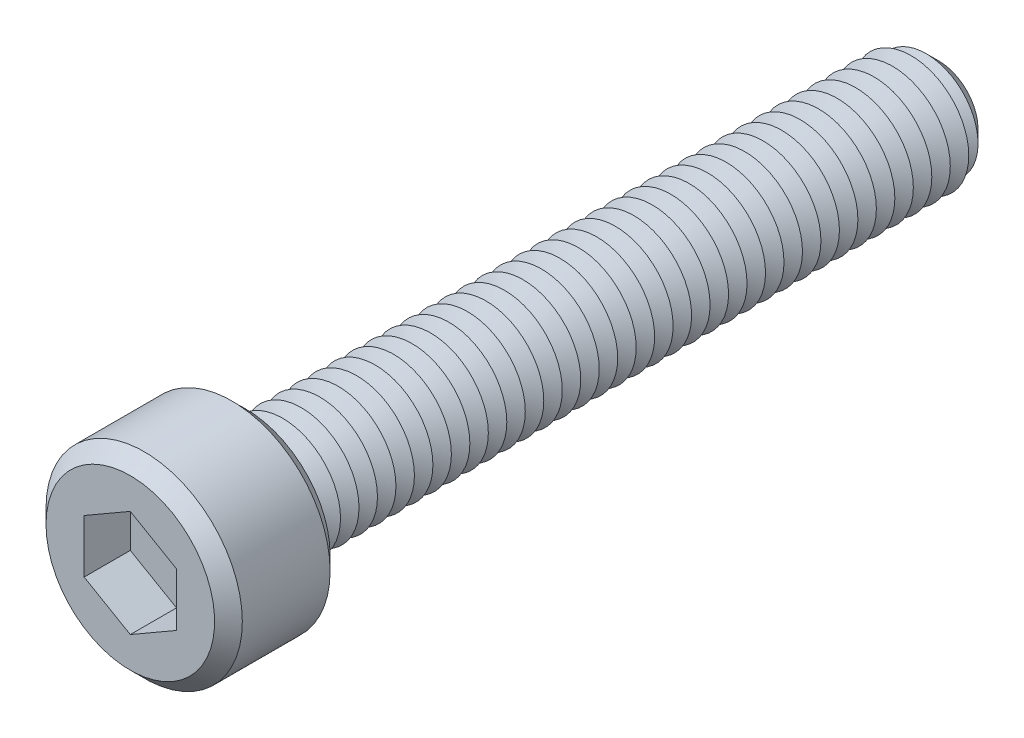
ISO-10303-21;
HEADER;
FILE_DESCRIPTION(('STEP AP214'),'2;1');
FILE_NAME('part.step','',(''),(''),'','','');
FILE_SCHEMA(('AUTOMOTIVE_DESIGN { 1 0 10303 214 1 1 1 1 }'));
ENDSEC;
DATA;
#1=APPLICATION_CONTEXT('core data for automotive mechanical design processes');
#2=APPLICATION_PROTOCOL_DEFINITION('international standard','automotive_design',2000,#1);
#3=PRODUCT_CONTEXT('',#1,'mechanical');
#4=PRODUCT('Part','Part','',(#3));
#5=PRODUCT_RELATED_PRODUCT_CATEGORY('part','',(#4));
#6=PRODUCT_DEFINITION_FORMATION('','',#4);
#7=PRODUCT_DEFINITION_CONTEXT('part definition',#1,'design');
#8=PRODUCT_DEFINITION('design','',#6,#7);
#9=PRODUCT_DEFINITION_SHAPE('','',#8);
#10=(LENGTH_UNIT() NAMED_UNIT(*) SI_UNIT(.MILLI.,.METRE.));
#11=(NAMED_UNIT(*) PLANE_ANGLE_UNIT() SI_UNIT($,.RADIAN.));
#12=(NAMED_UNIT(*) SI_UNIT($,.STERADIAN.) SOLID_ANGLE_UNIT());
#13=UNCERTAINTY_MEASURE_WITH_UNIT(LENGTH_MEASURE(1.E-05),#10,'distance_accuracy_value','');
#14=(GEOMETRIC_REPRESENTATION_CONTEXT(3) GLOBAL_UNCERTAINTY_ASSIGNED_CONTEXT((#13)) GLOBAL_UNIT_ASSIGNED_CONTEXT((#10,
#11,#12)) REPRESENTATION_CONTEXT('',''));
#15=CARTESIAN_POINT('',(0.,0.,0.));
#16=DIRECTION('',(0.,0.,1.));
#17=DIRECTION('',(1.,0.,0.));
#18=AXIS2_PLACEMENT_3D('',#15,#16,#17);
#19=CARTESIAN_POINT('',(0.,0.,5.));
#20=DIRECTION('',(0.,0.,-1.));
#21=DIRECTION('',(-1.,0.,0.));
#22=AXIS2_PLACEMENT_3D('',#19,#20,#21);
#23=CYLINDRICAL_SURFACE('',#22,4.25);
#24=CARTESIAN_POINT('',(0.,0.,0.600000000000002));
#25=DIRECTION('',(0.,0.,1.));
#26=DIRECTION('',(1.,0.,0.));
#27=AXIS2_PLACEMENT_3D('',#24,#25,#26);
#28=CIRCLE('',#27,4.25);
#29=CARTESIAN_POINT('',(4.25,0.,0.600000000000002));
#30=VERTEX_POINT('',#29);
#31=EDGE_CURVE('E472',#30,#30,#28,.T.);
#32=ORIENTED_EDGE('',*,*,#31,.T.);
#33=EDGE_LOOP('',(#32));
#34=FACE_BOUND('',#33,.T.);
#35=CARTESIAN_POINT('',(0.,0.,4.39999999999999));
#36=DIRECTION('',(0.,0.,1.));
#37=DIRECTION('',(1.,0.,0.));
#38=AXIS2_PLACEMENT_3D('',#35,#36,#37);
#39=CIRCLE('',#38,4.25);
#40=CARTESIAN_POINT('',(-4.25,0.,4.39999999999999));
#41=VERTEX_POINT('',#40);
#42=EDGE_CURVE('E466',#41,#41,#39,.F.);
#43=ORIENTED_EDGE('',*,*,#42,.T.);
#44=EDGE_LOOP('',(#43));
#45=FACE_BOUND('',#44,.T.);
#46=ADVANCED_FACE('F39',(#34,#45),#23,.T.);
#47=CARTESIAN_POINT('',(0.,0.,5.));
#48=DIRECTION('',(0.,0.,1.));
#49=DIRECTION('',(1.,0.,0.));
#50=AXIS2_PLACEMENT_3D('',#47,#48,#49);
#51=PLANE('',#50);
#52=CARTESIAN_POINT('',(0.,0.,5.));
#53=DIRECTION('',(0.,0.,1.));
#54=DIRECTION('',(1.,0.,0.));
#55=AXIS2_PLACEMENT_3D('',#52,#53,#54);
#56=CIRCLE('',#55,3.65);
#57=CARTESIAN_POINT('',(-3.65,0.,5.));
#58=VERTEX_POINT('',#57);
#59=EDGE_CURVE('E11',#58,#58,#56,.T.);
#60=ORIENTED_EDGE('',*,*,#59,.T.);
#61=EDGE_LOOP('',(#60));
#62=FACE_BOUND('',#61,.T.);
#63=DIRECTION('',(-0.866025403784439,0.5,0.));
#64=VECTOR('',#63,1.);
#65=CARTESIAN_POINT('',(2.,1.15470053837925,5.));
#66=LINE('',#65,#64);
#67=CARTESIAN_POINT('',(2.,1.15470053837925,5.));
#68=VERTEX_POINT('',#67);
#69=CARTESIAN_POINT('',(0.,2.3094010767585,5.));
#70=VERTEX_POINT('',#69);
#71=EDGE_CURVE('E55',#68,#70,#66,.T.);
#72=ORIENTED_EDGE('',*,*,#71,.F.);
#73=DIRECTION('',(0.,1.,0.));
#74=VECTOR('',#73,1.);
#75=CARTESIAN_POINT('',(2.,-1.15470053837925,5.));
#76=LINE('',#75,#74);
#77=CARTESIAN_POINT('',(2.,-1.15470053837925,5.));
#78=VERTEX_POINT('',#77);
#79=EDGE_CURVE('E151',#78,#68,#76,.T.);
#80=ORIENTED_EDGE('',*,*,#79,.F.);
#81=DIRECTION('',(0.866025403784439,0.5,0.));
#82=VECTOR('',#81,1.);
#83=CARTESIAN_POINT('',(0.,-2.3094010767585,5.));
#84=LINE('',#83,#82);
#85=CARTESIAN_POINT('',(0.,-2.3094010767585,5.));
#86=VERTEX_POINT('',#85);
#87=EDGE_CURVE('E148',#86,#78,#84,.T.);
#88=ORIENTED_EDGE('',*,*,#87,.F.);
#89=DIRECTION('',(0.866025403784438,-0.5,0.));
#90=VECTOR('',#89,1.);
#91=CARTESIAN_POINT('',(-2.,-1.15470053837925,5.));
#92=LINE('',#91,#90);
#93=CARTESIAN_POINT('',(-2.,-1.15470053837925,5.));
#94=VERTEX_POINT('',#93);
#95=EDGE_CURVE('E103',#94,#86,#92,.T.);
#96=ORIENTED_EDGE('',*,*,#95,.F.);
#97=DIRECTION('',(0.,-1.,0.));
#98=VECTOR('',#97,1.);
#99=CARTESIAN_POINT('',(-2.,1.15470053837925,5.));
#100=LINE('',#99,#98);
#101=CARTESIAN_POINT('',(-2.,1.15470053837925,5.));
#102=VERTEX_POINT('',#101);
#103=EDGE_CURVE('E142',#102,#94,#100,.T.);
#104=ORIENTED_EDGE('',*,*,#103,.F.);
#105=DIRECTION('',(-0.866025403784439,-0.5,0.));
#106=VECTOR('',#105,1.);
#107=CARTESIAN_POINT('',(0.,2.3094010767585,5.));
#108=LINE('',#107,#106);
#109=EDGE_CURVE('E137',#70,#102,#108,.T.);
#110=ORIENTED_EDGE('',*,*,#109,.F.);
#111=EDGE_LOOP('',(#72,#80,#88,#96,#104,#110));
#112=FACE_BOUND('',#111,.T.);
#113=ADVANCED_FACE('F490',(#62,#112),#51,.T.);
#114=CARTESIAN_POINT('',(0.,0.,0.));
#115=DIRECTION('',(0.,0.,1.));
#116=DIRECTION('',(1.,0.,0.));
#117=AXIS2_PLACEMENT_3D('',#114,#115,#116);
#118=PLANE('',#117);
#119=CARTESIAN_POINT('',(0.,0.,0.));
#120=DIRECTION('',(0.,0.,1.));
#121=DIRECTION('',(1.,0.,0.));
#122=AXIS2_PLACEMENT_3D('',#119,#120,#121);
#123=CIRCLE('',#122,3.64999999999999);
#124=CARTESIAN_POINT('',(3.64999999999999,0.,0.));
#125=VERTEX_POINT('',#124);
#126=EDGE_CURVE('E48',#125,#125,#123,.F.);
#127=ORIENTED_EDGE('',*,*,#126,.T.);
#128=EDGE_LOOP('',(#127));
#129=FACE_BOUND('',#128,.T.);
#130=CARTESIAN_POINT('',(0.,0.,0.));
#131=DIRECTION('',(0.,0.,1.));
#132=DIRECTION('',(1.,0.,0.));
#133=AXIS2_PLACEMENT_3D('',#130,#131,#132);
#134=CIRCLE('',#133,2.5);
#135=CARTESIAN_POINT('',(2.5,0.,0.));
#136=VERTEX_POINT('',#135);
#137=EDGE_CURVE('E458',#136,#136,#134,.T.);
#138=ORIENTED_EDGE('',*,*,#137,.T.);
#139=EDGE_LOOP('',(#138));
#140=FACE_BOUND('',#139,.T.);
#141=ADVANCED_FACE('F479',(#129,#140),#118,.F.);
#142=CARTESIAN_POINT('',(0.,0.,0.));
#143=DIRECTION('',(0.,0.,1.));
#144=DIRECTION('',(1.,0.,0.));
#145=AXIS2_PLACEMENT_3D('',#142,#143,#144);
#146=CONICAL_SURFACE('',#145,2.5,1.0471975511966);
#147=CARTESIAN_POINT('',(0.,0.,-0.4));
#148=DIRECTION('',(0.,0.,1.));
#149=DIRECTION('',(1.,0.,0.));
#150=AXIS2_PLACEMENT_3D('',#147,#148,#149);
#151=CIRCLE('',#150,1.80717967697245);
#152=CARTESIAN_POINT('',(1.80717967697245,0.,-0.4));
#153=VERTEX_POINT('',#152);
#154=EDGE_CURVE('E454',#153,#153,#151,.T.);
#155=ORIENTED_EDGE('',*,*,#154,.T.);
#156=EDGE_LOOP('',(#155));
#157=FACE_BOUND('',#156,.T.);
#158=ORIENTED_EDGE('',*,*,#137,.F.);
#159=EDGE_LOOP('',(#158));
#160=FACE_BOUND('',#159,.T.);
#161=ADVANCED_FACE('F836',(#157,#160),#146,.T.);
#162=CARTESIAN_POINT('',(0.,0.,-0.4));
#163=DIRECTION('',(0.,0.,-1.));
#164=DIRECTION('',(-1.,0.,0.));
#165=AXIS2_PLACEMENT_3D('',#162,#163,#164);
#166=CONICAL_SURFACE('',#165,1.80717967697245,1.0471975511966);
#167=CARTESIAN_POINT('',(0.,0.,-0.8));
#168=DIRECTION('',(0.,0.,1.));
#169=DIRECTION('',(1.,0.,0.));
#170=AXIS2_PLACEMENT_3D('',#167,#168,#169);
#171=CIRCLE('',#170,2.5);
#172=CARTESIAN_POINT('',(2.5,0.,-0.8));
#173=VERTEX_POINT('',#172);
#174=EDGE_CURVE('E450',#173,#173,#171,.T.);
#175=ORIENTED_EDGE('',*,*,#174,.T.);
#176=EDGE_LOOP('',(#175));
#177=FACE_BOUND('',#176,.T.);
#178=ORIENTED_EDGE('',*,*,#154,.F.);
#179=EDGE_LOOP('',(#178));
#180=FACE_BOUND('',#179,.T.);
#181=ADVANCED_FACE('F832',(#177,#180),#166,.T.);
#182=CARTESIAN_POINT('',(0.,0.,-0.8));
#183=DIRECTION('',(0.,0.,1.));
#184=DIRECTION('',(1.,0.,0.));
#185=AXIS2_PLACEMENT_3D('',#182,#183,#184);
#186=CONICAL_SURFACE('',#185,2.5,1.0471975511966);
#187=CARTESIAN_POINT('',(0.,0.,-1.2));
#188=DIRECTION('',(0.,0.,1.));
#189=DIRECTION('',(1.,0.,0.));
#190=AXIS2_PLACEMENT_3D('',#187,#188,#189);
#191=CIRCLE('',#190,1.80717967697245);
#192=CARTESIAN_POINT('',(1.80717967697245,0.,-1.2));
#193=VERTEX_POINT('',#192);
#194=EDGE_CURVE('E446',#193,#193,#191,.T.);
#195=ORIENTED_EDGE('',*,*,#194,.T.);
#196=EDGE_LOOP('',(#195));
#197=FACE_BOUND('',#196,.T.);
#198=ORIENTED_EDGE('',*,*,#174,.F.);
#199=EDGE_LOOP('',(#198));
#200=FACE_BOUND('',#199,.T.);
#201=ADVANCED_FACE('F828',(#197,#200),#186,.T.);
#202=CARTESIAN_POINT('',(0.,0.,-1.2));
#203=DIRECTION('',(0.,0.,-1.));
#204=DIRECTION('',(-1.,0.,0.));
#205=AXIS2_PLACEMENT_3D('',#202,#203,#204);
#206=CONICAL_SURFACE('',#205,1.80717967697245,1.0471975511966);
#207=CARTESIAN_POINT('',(0.,0.,-1.6));
#208=DIRECTION('',(0.,0.,1.));
#209=DIRECTION('',(1.,0.,0.));
#210=AXIS2_PLACEMENT_3D('',#207,#208,#209);
#211=CIRCLE('',#210,2.5);
#212=CARTESIAN_POINT('',(2.5,0.,-1.6));
#213=VERTEX_POINT('',#212);
#214=EDGE_CURVE('E442',#213,#213,#211,.T.);
#215=ORIENTED_EDGE('',*,*,#214,.T.);
#216=EDGE_LOOP('',(#215));
#217=FACE_BOUND('',#216,.T.);
#218=ORIENTED_EDGE('',*,*,#194,.F.);
#219=EDGE_LOOP('',(#218));
#220=FACE_BOUND('',#219,.T.);
#221=ADVANCED_FACE('F824',(#217,#220),#206,.T.);
#222=CARTESIAN_POINT('',(0.,0.,-1.6));
#223=DIRECTION('',(0.,0.,1.));
#224=DIRECTION('',(1.,0.,0.));
#225=AXIS2_PLACEMENT_3D('',#222,#223,#224);
#226=CONICAL_SURFACE('',#225,2.5,1.0471975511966);
#227=CARTESIAN_POINT('',(0.,0.,-2.));
#228=DIRECTION('',(0.,0.,1.));
#229=DIRECTION('',(1.,0.,0.));
#230=AXIS2_PLACEMENT_3D('',#227,#228,#229);
#231=CIRCLE('',#230,1.80717967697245);
#232=CARTESIAN_POINT('',(1.80717967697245,0.,-2.));
#233=VERTEX_POINT('',#232);
#234=EDGE_CURVE('E438',#233,#233,#231,.T.);
#235=ORIENTED_EDGE('',*,*,#234,.T.);
#236=EDGE_LOOP('',(#235));
#237=FACE_BOUND('',#236,.T.);
#238=ORIENTED_EDGE('',*,*,#214,.F.);
#239=EDGE_LOOP('',(#238));
#240=FACE_BOUND('',#239,.T.);
#241=ADVANCED_FACE('F820',(#237,#240),#226,.T.);
#242=CARTESIAN_POINT('',(0.,0.,-2.));
#243=DIRECTION('',(0.,0.,-1.));
#244=DIRECTION('',(-1.,0.,0.));
#245=AXIS2_PLACEMENT_3D('',#242,#243,#244);
#246=CONICAL_SURFACE('',#245,1.80717967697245,1.0471975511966);
#247=CARTESIAN_POINT('',(0.,0.,-2.4));
#248=DIRECTION('',(0.,0.,1.));
#249=DIRECTION('',(1.,0.,0.));
#250=AXIS2_PLACEMENT_3D('',#247,#248,#249);
#251=CIRCLE('',#250,2.5);
#252=CARTESIAN_POINT('',(2.5,0.,-2.4));
#253=VERTEX_POINT('',#252);
#254=EDGE_CURVE('E434',#253,#253,#251,.T.);
#255=ORIENTED_EDGE('',*,*,#254,.T.);
#256=EDGE_LOOP('',(#255));
#257=FACE_BOUND('',#256,.T.);
#258=ORIENTED_EDGE('',*,*,#234,.F.);
#259=EDGE_LOOP('',(#258));
#260=FACE_BOUND('',#259,.T.);
#261=ADVANCED_FACE('F816',(#257,#260),#246,.T.);
#262=CARTESIAN_POINT('',(0.,0.,-2.4));
#263=DIRECTION('',(0.,0.,1.));
#264=DIRECTION('',(1.,0.,0.));
#265=AXIS2_PLACEMENT_3D('',#262,#263,#264);
#266=CONICAL_SURFACE('',#265,2.5,1.0471975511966);
#267=CARTESIAN_POINT('',(0.,0.,-2.8));
#268=DIRECTION('',(0.,0.,1.));
#269=DIRECTION('',(1.,0.,0.));
#270=AXIS2_PLACEMENT_3D('',#267,#268,#269);
#271=CIRCLE('',#270,1.80717967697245);
#272=CARTESIAN_POINT('',(1.80717967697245,0.,-2.8));
#273=VERTEX_POINT('',#272);
#274=EDGE_CURVE('E430',#273,#273,#271,.T.);
#275=ORIENTED_EDGE('',*,*,#274,.T.);
#276=EDGE_LOOP('',(#275));
#277=FACE_BOUND('',#276,.T.);
#278=ORIENTED_EDGE('',*,*,#254,.F.);
#279=EDGE_LOOP('',(#278));
#280=FACE_BOUND('',#279,.T.);
#281=ADVANCED_FACE('F812',(#277,#280),#266,.T.);
#282=CARTESIAN_POINT('',(0.,0.,-2.8));
#283=DIRECTION('',(0.,0.,-1.));
#284=DIRECTION('',(-1.,0.,0.));
#285=AXIS2_PLACEMENT_3D('',#282,#283,#284);
#286=CONICAL_SURFACE('',#285,1.80717967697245,1.0471975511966);
#287=CARTESIAN_POINT('',(0.,0.,-3.2));
#288=DIRECTION('',(0.,0.,1.));
#289=DIRECTION('',(1.,0.,0.));
#290=AXIS2_PLACEMENT_3D('',#287,#288,#289);
#291=CIRCLE('',#290,2.5);
#292=CARTESIAN_POINT('',(2.5,0.,-3.2));
#293=VERTEX_POINT('',#292);
#294=EDGE_CURVE('E426',#293,#293,#291,.T.);
#295=ORIENTED_EDGE('',*,*,#294,.T.);
#296=EDGE_LOOP('',(#295));
#297=FACE_BOUND('',#296,.T.);
#298=ORIENTED_EDGE('',*,*,#274,.F.);
#299=EDGE_LOOP('',(#298));
#300=FACE_BOUND('',#299,.T.);
#301=ADVANCED_FACE('F808',(#297,#300),#286,.T.);
#302=CARTESIAN_POINT('',(0.,0.,-3.2));
#303=DIRECTION('',(0.,0.,1.));
#304=DIRECTION('',(1.,0.,0.));
#305=AXIS2_PLACEMENT_3D('',#302,#303,#304);
#306=CONICAL_SURFACE('',#305,2.5,1.0471975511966);
#307=CARTESIAN_POINT('',(0.,0.,-3.6));
#308=DIRECTION('',(0.,0.,1.));
#309=DIRECTION('',(1.,0.,0.));
#310=AXIS2_PLACEMENT_3D('',#307,#308,#309);
#311=CIRCLE('',#310,1.80717967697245);
#312=CARTESIAN_POINT('',(1.80717967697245,0.,-3.6));
#313=VERTEX_POINT('',#312);
#314=EDGE_CURVE('E422',#313,#313,#311,.T.);
#315=ORIENTED_EDGE('',*,*,#314,.T.);
#316=EDGE_LOOP('',(#315));
#317=FACE_BOUND('',#316,.T.);
#318=ORIENTED_EDGE('',*,*,#294,.F.);
#319=EDGE_LOOP('',(#318));
#320=FACE_BOUND('',#319,.T.);
#321=ADVANCED_FACE('F804',(#317,#320),#306,.T.);
#322=CARTESIAN_POINT('',(0.,0.,-3.6));
#323=DIRECTION('',(0.,0.,-1.));
#324=DIRECTION('',(-1.,0.,0.));
#325=AXIS2_PLACEMENT_3D('',#322,#323,#324);
#326=CONICAL_SURFACE('',#325,1.80717967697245,1.0471975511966);
#327=CARTESIAN_POINT('',(0.,0.,-4.));
#328=DIRECTION('',(0.,0.,1.));
#329=DIRECTION('',(1.,0.,0.));
#330=AXIS2_PLACEMENT_3D('',#327,#328,#329);
#331=CIRCLE('',#330,2.5);
#332=CARTESIAN_POINT('',(2.5,0.,-4.));
#333=VERTEX_POINT('',#332);
#334=EDGE_CURVE('E418',#333,#333,#331,.T.);
#335=ORIENTED_EDGE('',*,*,#334,.T.);
#336=EDGE_LOOP('',(#335));
#337=FACE_BOUND('',#336,.T.);
#338=ORIENTED_EDGE('',*,*,#314,.F.);
#339=EDGE_LOOP('',(#338));
#340=FACE_BOUND('',#339,.T.);
#341=ADVANCED_FACE('F800',(#337,#340),#326,.T.);
#342=CARTESIAN_POINT('',(0.,0.,-4.));
#343=DIRECTION('',(0.,0.,1.));
#344=DIRECTION('',(1.,0.,0.));
#345=AXIS2_PLACEMENT_3D('',#342,#343,#344);
#346=CONICAL_SURFACE('',#345,2.5,1.0471975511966);
#347=CARTESIAN_POINT('',(0.,0.,-4.4));
#348=DIRECTION('',(0.,0.,1.));
#349=DIRECTION('',(1.,0.,0.));
#350=AXIS2_PLACEMENT_3D('',#347,#348,#349);
#351=CIRCLE('',#350,1.80717967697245);
#352=CARTESIAN_POINT('',(1.80717967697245,0.,-4.4));
#353=VERTEX_POINT('',#352);
#354=EDGE_CURVE('E414',#353,#353,#351,.T.);
#355=ORIENTED_EDGE('',*,*,#354,.T.);
#356=EDGE_LOOP('',(#355));
#357=FACE_BOUND('',#356,.T.);
#358=ORIENTED_EDGE('',*,*,#334,.F.);
#359=EDGE_LOOP('',(#358));
#360=FACE_BOUND('',#359,.T.);
#361=ADVANCED_FACE('F796',(#357,#360),#346,.T.);
#362=CARTESIAN_POINT('',(0.,0.,-4.4));
#363=DIRECTION('',(0.,0.,-1.));
#364=DIRECTION('',(-1.,0.,0.));
#365=AXIS2_PLACEMENT_3D('',#362,#363,#364);
#366=CONICAL_SURFACE('',#365,1.80717967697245,1.0471975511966);
#367=CARTESIAN_POINT('',(0.,0.,-4.8));
#368=DIRECTION('',(0.,0.,1.));
#369=DIRECTION('',(1.,0.,0.));
#370=AXIS2_PLACEMENT_3D('',#367,#368,#369);
#371=CIRCLE('',#370,2.5);
#372=CARTESIAN_POINT('',(2.5,0.,-4.8));
#373=VERTEX_POINT('',#372);
#374=EDGE_CURVE('E410',#373,#373,#371,.T.);
#375=ORIENTED_EDGE('',*,*,#374,.T.);
#376=EDGE_LOOP('',(#375));
#377=FACE_BOUND('',#376,.T.);
#378=ORIENTED_EDGE('',*,*,#354,.F.);
#379=EDGE_LOOP('',(#378));
#380=FACE_BOUND('',#379,.T.);
#381=ADVANCED_FACE('F792',(#377,#380),#366,.T.);
#382=CARTESIAN_POINT('',(0.,0.,-4.8));
#383=DIRECTION('',(0.,0.,1.));
#384=DIRECTION('',(1.,0.,0.));
#385=AXIS2_PLACEMENT_3D('',#382,#383,#384);
#386=CONICAL_SURFACE('',#385,2.5,1.0471975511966);
#387=CARTESIAN_POINT('',(0.,0.,-5.2));
#388=DIRECTION('',(0.,0.,1.));
#389=DIRECTION('',(1.,0.,0.));
#390=AXIS2_PLACEMENT_3D('',#387,#388,#389);
#391=CIRCLE('',#390,1.80717967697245);
#392=CARTESIAN_POINT('',(1.80717967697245,0.,-5.2));
#393=VERTEX_POINT('',#392);
#394=EDGE_CURVE('E406',#393,#393,#391,.T.);
#395=ORIENTED_EDGE('',*,*,#394,.T.);
#396=EDGE_LOOP('',(#395));
#397=FACE_BOUND('',#396,.T.);
#398=ORIENTED_EDGE('',*,*,#374,.F.);
#399=EDGE_LOOP('',(#398));
#400=FACE_BOUND('',#399,.T.);
#401=ADVANCED_FACE('F788',(#397,#400),#386,.T.);
#402=CARTESIAN_POINT('',(0.,0.,-5.2));
#403=DIRECTION('',(0.,0.,-1.));
#404=DIRECTION('',(-1.,0.,0.));
#405=AXIS2_PLACEMENT_3D('',#402,#403,#404);
#406=CONICAL_SURFACE('',#405,1.80717967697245,1.0471975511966);
#407=CARTESIAN_POINT('',(0.,0.,-5.6));
#408=DIRECTION('',(0.,0.,1.));
#409=DIRECTION('',(1.,0.,0.));
#410=AXIS2_PLACEMENT_3D('',#407,#408,#409);
#411=CIRCLE('',#410,2.5);
#412=CARTESIAN_POINT('',(2.5,0.,-5.6));
#413=VERTEX_POINT('',#412);
#414=EDGE_CURVE('E402',#413,#413,#411,.T.);
#415=ORIENTED_EDGE('',*,*,#414,.T.);
#416=EDGE_LOOP('',(#415));
#417=FACE_BOUND('',#416,.T.);
#418=ORIENTED_EDGE('',*,*,#394,.F.);
#419=EDGE_LOOP('',(#418));
#420=FACE_BOUND('',#419,.T.);
#421=ADVANCED_FACE('F784',(#417,#420),#406,.T.);
#422=CARTESIAN_POINT('',(0.,0.,-5.6));
#423=DIRECTION('',(0.,0.,1.));
#424=DIRECTION('',(1.,0.,0.));
#425=AXIS2_PLACEMENT_3D('',#422,#423,#424);
#426=CONICAL_SURFACE('',#425,2.5,1.0471975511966);
#427=CARTESIAN_POINT('',(0.,0.,-6.));
#428=DIRECTION('',(0.,0.,1.));
#429=DIRECTION('',(1.,0.,0.));
#430=AXIS2_PLACEMENT_3D('',#427,#428,#429);
#431=CIRCLE('',#430,1.80717967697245);
#432=CARTESIAN_POINT('',(1.80717967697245,0.,-6.));
#433=VERTEX_POINT('',#432);
#434=EDGE_CURVE('E398',#433,#433,#431,.T.);
#435=ORIENTED_EDGE('',*,*,#434,.T.);
#436=EDGE_LOOP('',(#435));
#437=FACE_BOUND('',#436,.T.);
#438=ORIENTED_EDGE('',*,*,#414,.F.);
#439=EDGE_LOOP('',(#438));
#440=FACE_BOUND('',#439,.T.);
#441=ADVANCED_FACE('F780',(#437,#440),#426,.T.);
#442=CARTESIAN_POINT('',(0.,0.,-6.));
#443=DIRECTION('',(0.,0.,-1.));
#444=DIRECTION('',(-1.,0.,0.));
#445=AXIS2_PLACEMENT_3D('',#442,#443,#444);
#446=CONICAL_SURFACE('',#445,1.80717967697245,1.0471975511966);
#447=CARTESIAN_POINT('',(0.,0.,-6.4));
#448=DIRECTION('',(0.,0.,1.));
#449=DIRECTION('',(1.,0.,0.));
#450=AXIS2_PLACEMENT_3D('',#447,#448,#449);
#451=CIRCLE('',#450,2.5);
#452=CARTESIAN_POINT('',(2.5,0.,-6.4));
#453=VERTEX_POINT('',#452);
#454=EDGE_CURVE('E394',#453,#453,#451,.T.);
#455=ORIENTED_EDGE('',*,*,#454,.T.);
#456=EDGE_LOOP('',(#455));
#457=FACE_BOUND('',#456,.T.);
#458=ORIENTED_EDGE('',*,*,#434,.F.);
#459=EDGE_LOOP('',(#458));
#460=FACE_BOUND('',#459,.T.);
#461=ADVANCED_FACE('F776',(#457,#460),#446,.T.);
#462=CARTESIAN_POINT('',(0.,0.,-6.4));
#463=DIRECTION('',(0.,0.,1.));
#464=DIRECTION('',(1.,0.,0.));
#465=AXIS2_PLACEMENT_3D('',#462,#463,#464);
#466=CONICAL_SURFACE('',#465,2.5,1.0471975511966);
#467=CARTESIAN_POINT('',(0.,0.,-6.8));
#468=DIRECTION('',(0.,0.,1.));
#469=DIRECTION('',(1.,0.,0.));
#470=AXIS2_PLACEMENT_3D('',#467,#468,#469);
#471=CIRCLE('',#470,1.80717967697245);
#472=CARTESIAN_POINT('',(1.80717967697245,0.,-6.8));
#473=VERTEX_POINT('',#472);
#474=EDGE_CURVE('E390',#473,#473,#471,.T.);
#475=ORIENTED_EDGE('',*,*,#474,.T.);
#476=EDGE_LOOP('',(#475));
#477=FACE_BOUND('',#476,.T.);
#478=ORIENTED_EDGE('',*,*,#454,.F.);
#479=EDGE_LOOP('',(#478));
#480=FACE_BOUND('',#479,.T.);
#481=ADVANCED_FACE('F772',(#477,#480),#466,.T.);
#482=CARTESIAN_POINT('',(0.,0.,-6.8));
#483=DIRECTION('',(0.,0.,-1.));
#484=DIRECTION('',(-1.,0.,0.));
#485=AXIS2_PLACEMENT_3D('',#482,#483,#484);
#486=CONICAL_SURFACE('',#485,1.80717967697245,1.0471975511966);
#487=CARTESIAN_POINT('',(0.,0.,-7.2));
#488=DIRECTION('',(0.,0.,1.));
#489=DIRECTION('',(1.,0.,0.));
#490=AXIS2_PLACEMENT_3D('',#487,#488,#489);
#491=CIRCLE('',#490,2.5);
#492=CARTESIAN_POINT('',(2.5,0.,-7.2));
#493=VERTEX_POINT('',#492);
#494=EDGE_CURVE('E386',#493,#493,#491,.T.);
#495=ORIENTED_EDGE('',*,*,#494,.T.);
#496=EDGE_LOOP('',(#495));
#497=FACE_BOUND('',#496,.T.);
#498=ORIENTED_EDGE('',*,*,#474,.F.);
#499=EDGE_LOOP('',(#498));
#500=FACE_BOUND('',#499,.T.);
#501=ADVANCED_FACE('F768',(#497,#500),#486,.T.);
#502=CARTESIAN_POINT('',(0.,0.,-7.2));
#503=DIRECTION('',(0.,0.,1.));
#504=DIRECTION('',(1.,0.,0.));
#505=AXIS2_PLACEMENT_3D('',#502,#503,#504);
#506=CONICAL_SURFACE('',#505,2.5,1.0471975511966);
#507=CARTESIAN_POINT('',(0.,0.,-7.6));
#508=DIRECTION('',(0.,0.,1.));
#509=DIRECTION('',(1.,0.,0.));
#510=AXIS2_PLACEMENT_3D('',#507,#508,#509);
#511=CIRCLE('',#510,1.80717967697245);
#512=CARTESIAN_POINT('',(1.80717967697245,0.,-7.6));
#513=VERTEX_POINT('',#512);
#514=EDGE_CURVE('E382',#513,#513,#511,.T.);
#515=ORIENTED_EDGE('',*,*,#514,.T.);
#516=EDGE_LOOP('',(#515));
#517=FACE_BOUND('',#516,.T.);
#518=ORIENTED_EDGE('',*,*,#494,.F.);
#519=EDGE_LOOP('',(#518));
#520=FACE_BOUND('',#519,.T.);
#521=ADVANCED_FACE('F764',(#517,#520),#506,.T.);
#522=CARTESIAN_POINT('',(0.,0.,-7.6));
#523=DIRECTION('',(0.,0.,-1.));
#524=DIRECTION('',(-1.,0.,0.));
#525=AXIS2_PLACEMENT_3D('',#522,#523,#524);
#526=CONICAL_SURFACE('',#525,1.80717967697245,1.0471975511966);
#527=CARTESIAN_POINT('',(0.,0.,-8.));
#528=DIRECTION('',(0.,0.,1.));
#529=DIRECTION('',(1.,0.,0.));
#530=AXIS2_PLACEMENT_3D('',#527,#528,#529);
#531=CIRCLE('',#530,2.5);
#532=CARTESIAN_POINT('',(2.5,0.,-8.));
#533=VERTEX_POINT('',#532);
#534=EDGE_CURVE('E378',#533,#533,#531,.T.);
#535=ORIENTED_EDGE('',*,*,#534,.T.);
#536=EDGE_LOOP('',(#535));
#537=FACE_BOUND('',#536,.T.);
#538=ORIENTED_EDGE('',*,*,#514,.F.);
#539=EDGE_LOOP('',(#538));
#540=FACE_BOUND('',#539,.T.);
#541=ADVANCED_FACE('F760',(#537,#540),#526,.T.);
#542=CARTESIAN_POINT('',(0.,0.,-8.));
#543=DIRECTION('',(0.,0.,1.));
#544=DIRECTION('',(1.,0.,0.));
#545=AXIS2_PLACEMENT_3D('',#542,#543,#544);
#546=CONICAL_SURFACE('',#545,2.5,1.0471975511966);
#547=CARTESIAN_POINT('',(0.,0.,-8.4));
#548=DIRECTION('',(0.,0.,1.));
#549=DIRECTION('',(1.,0.,0.));
#550=AXIS2_PLACEMENT_3D('',#547,#548,#549);
#551=CIRCLE('',#550,1.80717967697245);
#552=CARTESIAN_POINT('',(1.80717967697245,0.,-8.4));
#553=VERTEX_POINT('',#552);
#554=EDGE_CURVE('E374',#553,#553,#551,.T.);
#555=ORIENTED_EDGE('',*,*,#554,.T.);
#556=EDGE_LOOP('',(#555));
#557=FACE_BOUND('',#556,.T.);
#558=ORIENTED_EDGE('',*,*,#534,.F.);
#559=EDGE_LOOP('',(#558));
#560=FACE_BOUND('',#559,.T.);
#561=ADVANCED_FACE('F756',(#557,#560),#546,.T.);
#562=CARTESIAN_POINT('',(0.,0.,-8.4));
#563=DIRECTION('',(0.,0.,-1.));
#564=DIRECTION('',(-1.,0.,0.));
#565=AXIS2_PLACEMENT_3D('',#562,#563,#564);
#566=CONICAL_SURFACE('',#565,1.80717967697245,1.0471975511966);
#567=CARTESIAN_POINT('',(0.,0.,-8.8));
#568=DIRECTION('',(0.,0.,1.));
#569=DIRECTION('',(1.,0.,0.));
#570=AXIS2_PLACEMENT_3D('',#567,#568,#569);
#571=CIRCLE('',#570,2.5);
#572=CARTESIAN_POINT('',(2.5,0.,-8.8));
#573=VERTEX_POINT('',#572);
#574=EDGE_CURVE('E370',#573,#573,#571,.T.);
#575=ORIENTED_EDGE('',*,*,#574,.T.);
#576=EDGE_LOOP('',(#575));
#577=FACE_BOUND('',#576,.T.);
#578=ORIENTED_EDGE('',*,*,#554,.F.);
#579=EDGE_LOOP('',(#578));
#580=FACE_BOUND('',#579,.T.);
#581=ADVANCED_FACE('F752',(#577,#580),#566,.T.);
#582=CARTESIAN_POINT('',(0.,0.,-8.8));
#583=DIRECTION('',(0.,0.,1.));
#584=DIRECTION('',(1.,0.,0.));
#585=AXIS2_PLACEMENT_3D('',#582,#583,#584);
#586=CONICAL_SURFACE('',#585,2.5,1.0471975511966);
#587=CARTESIAN_POINT('',(0.,0.,-9.2));
#588=DIRECTION('',(0.,0.,1.));
#589=DIRECTION('',(1.,0.,0.));
#590=AXIS2_PLACEMENT_3D('',#587,#588,#589);
#591=CIRCLE('',#590,1.80717967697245);
#592=CARTESIAN_POINT('',(1.80717967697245,0.,-9.2));
#593=VERTEX_POINT('',#592);
#594=EDGE_CURVE('E366',#593,#593,#591,.T.);
#595=ORIENTED_EDGE('',*,*,#594,.T.);
#596=EDGE_LOOP('',(#595));
#597=FACE_BOUND('',#596,.T.);
#598=ORIENTED_EDGE('',*,*,#574,.F.);
#599=EDGE_LOOP('',(#598));
#600=FACE_BOUND('',#599,.T.);
#601=ADVANCED_FACE('F748',(#597,#600),#586,.T.);
#602=CARTESIAN_POINT('',(0.,0.,-9.2));
#603=DIRECTION('',(0.,0.,-1.));
#604=DIRECTION('',(-1.,0.,0.));
#605=AXIS2_PLACEMENT_3D('',#602,#603,#604);
#606=CONICAL_SURFACE('',#605,1.80717967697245,1.0471975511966);
#607=CARTESIAN_POINT('',(0.,0.,-9.6));
#608=DIRECTION('',(0.,0.,1.));
#609=DIRECTION('',(1.,0.,0.));
#610=AXIS2_PLACEMENT_3D('',#607,#608,#609);
#611=CIRCLE('',#610,2.5);
#612=CARTESIAN_POINT('',(2.5,0.,-9.6));
#613=VERTEX_POINT('',#612);
#614=EDGE_CURVE('E362',#613,#613,#611,.T.);
#615=ORIENTED_EDGE('',*,*,#614,.T.);
#616=EDGE_LOOP('',(#615));
#617=FACE_BOUND('',#616,.T.);
#618=ORIENTED_EDGE('',*,*,#594,.F.);
#619=EDGE_LOOP('',(#618));
#620=FACE_BOUND('',#619,.T.);
#621=ADVANCED_FACE('F744',(#617,#620),#606,.T.);
#622=CARTESIAN_POINT('',(0.,0.,-9.6));
#623=DIRECTION('',(0.,0.,1.));
#624=DIRECTION('',(1.,0.,0.));
#625=AXIS2_PLACEMENT_3D('',#622,#623,#624);
#626=CONICAL_SURFACE('',#625,2.5,1.0471975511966);
#627=CARTESIAN_POINT('',(0.,0.,-10.));
#628=DIRECTION('',(0.,0.,1.));
#629=DIRECTION('',(1.,0.,0.));
#630=AXIS2_PLACEMENT_3D('',#627,#628,#629);
#631=CIRCLE('',#630,1.80717967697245);
#632=CARTESIAN_POINT('',(1.80717967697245,0.,-10.));
#633=VERTEX_POINT('',#632);
#634=EDGE_CURVE('E358',#633,#633,#631,.T.);
#635=ORIENTED_EDGE('',*,*,#634,.T.);
#636=EDGE_LOOP('',(#635));
#637=FACE_BOUND('',#636,.T.);
#638=ORIENTED_EDGE('',*,*,#614,.F.);
#639=EDGE_LOOP('',(#638));
#640=FACE_BOUND('',#639,.T.);
#641=ADVANCED_FACE('F740',(#637,#640),#626,.T.);
#642=CARTESIAN_POINT('',(0.,0.,-10.));
#643=DIRECTION('',(0.,0.,-1.));
#644=DIRECTION('',(-1.,0.,0.));
#645=AXIS2_PLACEMENT_3D('',#642,#643,#644);
#646=CONICAL_SURFACE('',#645,1.80717967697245,1.0471975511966);
#647=CARTESIAN_POINT('',(0.,0.,-10.4));
#648=DIRECTION('',(0.,0.,1.));
#649=DIRECTION('',(1.,0.,0.));
#650=AXIS2_PLACEMENT_3D('',#647,#648,#649);
#651=CIRCLE('',#650,2.5);
#652=CARTESIAN_POINT('',(2.5,0.,-10.4));
#653=VERTEX_POINT('',#652);
#654=EDGE_CURVE('E354',#653,#653,#651,.T.);
#655=ORIENTED_EDGE('',*,*,#654,.T.);
#656=EDGE_LOOP('',(#655));
#657=FACE_BOUND('',#656,.T.);
#658=ORIENTED_EDGE('',*,*,#634,.F.);
#659=EDGE_LOOP('',(#658));
#660=FACE_BOUND('',#659,.T.);
#661=ADVANCED_FACE('F736',(#657,#660),#646,.T.);
#662=CARTESIAN_POINT('',(0.,0.,-10.4));
#663=DIRECTION('',(0.,0.,1.));
#664=DIRECTION('',(1.,0.,0.));
#665=AXIS2_PLACEMENT_3D('',#662,#663,#664);
#666=CONICAL_SURFACE('',#665,2.5,1.0471975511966);
#667=CARTESIAN_POINT('',(0.,0.,-10.8));
#668=DIRECTION('',(0.,0.,1.));
#669=DIRECTION('',(1.,0.,0.));
#670=AXIS2_PLACEMENT_3D('',#667,#668,#669);
#671=CIRCLE('',#670,1.80717967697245);
#672=CARTESIAN_POINT('',(1.80717967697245,0.,-10.8));
#673=VERTEX_POINT('',#672);
#674=EDGE_CURVE('E350',#673,#673,#671,.T.);
#675=ORIENTED_EDGE('',*,*,#674,.T.);
#676=EDGE_LOOP('',(#675));
#677=FACE_BOUND('',#676,.T.);
#678=ORIENTED_EDGE('',*,*,#654,.F.);
#679=EDGE_LOOP('',(#678));
#680=FACE_BOUND('',#679,.T.);
#681=ADVANCED_FACE('F732',(#677,#680),#666,.T.);
#682=CARTESIAN_POINT('',(0.,0.,-10.8));
#683=DIRECTION('',(0.,0.,-1.));
#684=DIRECTION('',(-1.,0.,0.));
#685=AXIS2_PLACEMENT_3D('',#682,#683,#684);
#686=CONICAL_SURFACE('',#685,1.80717967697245,1.0471975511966);
#687=CARTESIAN_POINT('',(0.,0.,-11.2));
#688=DIRECTION('',(0.,0.,1.));
#689=DIRECTION('',(1.,0.,0.));
#690=AXIS2_PLACEMENT_3D('',#687,#688,#689);
#691=CIRCLE('',#690,2.5);
#692=CARTESIAN_POINT('',(2.5,0.,-11.2));
#693=VERTEX_POINT('',#692);
#694=EDGE_CURVE('E346',#693,#693,#691,.T.);
#695=ORIENTED_EDGE('',*,*,#694,.T.);
#696=EDGE_LOOP('',(#695));
#697=FACE_BOUND('',#696,.T.);
#698=ORIENTED_EDGE('',*,*,#674,.F.);
#699=EDGE_LOOP('',(#698));
#700=FACE_BOUND('',#699,.T.);
#701=ADVANCED_FACE('F728',(#697,#700),#686,.T.);
#702=CARTESIAN_POINT('',(0.,0.,-11.2));
#703=DIRECTION('',(0.,0.,1.));
#704=DIRECTION('',(1.,0.,0.));
#705=AXIS2_PLACEMENT_3D('',#702,#703,#704);
#706=CONICAL_SURFACE('',#705,2.5,1.0471975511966);
#707=CARTESIAN_POINT('',(0.,0.,-11.6));
#708=DIRECTION('',(0.,0.,1.));
#709=DIRECTION('',(1.,0.,0.));
#710=AXIS2_PLACEMENT_3D('',#707,#708,#709);
#711=CIRCLE('',#710,1.80717967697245);
#712=CARTESIAN_POINT('',(1.80717967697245,0.,-11.6));
#713=VERTEX_POINT('',#712);
#714=EDGE_CURVE('E342',#713,#713,#711,.T.);
#715=ORIENTED_EDGE('',*,*,#714,.T.);
#716=EDGE_LOOP('',(#715));
#717=FACE_BOUND('',#716,.T.);
#718=ORIENTED_EDGE('',*,*,#694,.F.);
#719=EDGE_LOOP('',(#718));
#720=FACE_BOUND('',#719,.T.);
#721=ADVANCED_FACE('F724',(#717,#720),#706,.T.);
#722=CARTESIAN_POINT('',(0.,0.,-11.6));
#723=DIRECTION('',(0.,0.,-1.));
#724=DIRECTION('',(-1.,0.,0.));
#725=AXIS2_PLACEMENT_3D('',#722,#723,#724);
#726=CONICAL_SURFACE('',#725,1.80717967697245,1.0471975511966);
#727=CARTESIAN_POINT('',(0.,0.,-12.));
#728=DIRECTION('',(0.,0.,1.));
#729=DIRECTION('',(1.,0.,0.));
#730=AXIS2_PLACEMENT_3D('',#727,#728,#729);
#731=CIRCLE('',#730,2.5);
#732=CARTESIAN_POINT('',(2.5,0.,-12.));
#733=VERTEX_POINT('',#732);
#734=EDGE_CURVE('E338',#733,#733,#731,.T.);
#735=ORIENTED_EDGE('',*,*,#734,.T.);
#736=EDGE_LOOP('',(#735));
#737=FACE_BOUND('',#736,.T.);
#738=ORIENTED_EDGE('',*,*,#714,.F.);
#739=EDGE_LOOP('',(#738));
#740=FACE_BOUND('',#739,.T.);
#741=ADVANCED_FACE('F720',(#737,#740),#726,.T.);
#742=CARTESIAN_POINT('',(0.,0.,-12.));
#743=DIRECTION('',(0.,0.,1.));
#744=DIRECTION('',(1.,0.,0.));
#745=AXIS2_PLACEMENT_3D('',#742,#743,#744);
#746=CONICAL_SURFACE('',#745,2.5,1.0471975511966);
#747=CARTESIAN_POINT('',(0.,0.,-12.4));
#748=DIRECTION('',(0.,0.,1.));
#749=DIRECTION('',(1.,0.,0.));
#750=AXIS2_PLACEMENT_3D('',#747,#748,#749);
#751=CIRCLE('',#750,1.80717967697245);
#752=CARTESIAN_POINT('',(1.80717967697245,0.,-12.4));
#753=VERTEX_POINT('',#752);
#754=EDGE_CURVE('E334',#753,#753,#751,.T.);
#755=ORIENTED_EDGE('',*,*,#754,.T.);
#756=EDGE_LOOP('',(#755));
#757=FACE_BOUND('',#756,.T.);
#758=ORIENTED_EDGE('',*,*,#734,.F.);
#759=EDGE_LOOP('',(#758));
#760=FACE_BOUND('',#759,.T.);
#761=ADVANCED_FACE('F716',(#757,#760),#746,.T.);
#762=CARTESIAN_POINT('',(0.,0.,-12.4));
#763=DIRECTION('',(0.,0.,-1.));
#764=DIRECTION('',(-1.,0.,0.));
#765=AXIS2_PLACEMENT_3D('',#762,#763,#764);
#766=CONICAL_SURFACE('',#765,1.80717967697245,1.0471975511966);
#767=CARTESIAN_POINT('',(0.,0.,-12.8));
#768=DIRECTION('',(0.,0.,1.));
#769=DIRECTION('',(1.,0.,0.));
#770=AXIS2_PLACEMENT_3D('',#767,#768,#769);
#771=CIRCLE('',#770,2.5);
#772=CARTESIAN_POINT('',(2.5,0.,-12.8));
#773=VERTEX_POINT('',#772);
#774=EDGE_CURVE('E330',#773,#773,#771,.T.);
#775=ORIENTED_EDGE('',*,*,#774,.T.);
#776=EDGE_LOOP('',(#775));
#777=FACE_BOUND('',#776,.T.);
#778=ORIENTED_EDGE('',*,*,#754,.F.);
#779=EDGE_LOOP('',(#778));
#780=FACE_BOUND('',#779,.T.);
#781=ADVANCED_FACE('F712',(#777,#780),#766,.T.);
#782=CARTESIAN_POINT('',(0.,0.,-12.8));
#783=DIRECTION('',(0.,0.,1.));
#784=DIRECTION('',(1.,0.,0.));
#785=AXIS2_PLACEMENT_3D('',#782,#783,#784);
#786=CONICAL_SURFACE('',#785,2.5,1.0471975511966);
#787=CARTESIAN_POINT('',(0.,0.,-13.2));
#788=DIRECTION('',(0.,0.,1.));
#789=DIRECTION('',(1.,0.,0.));
#790=AXIS2_PLACEMENT_3D('',#787,#788,#789);
#791=CIRCLE('',#790,1.80717967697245);
#792=CARTESIAN_POINT('',(1.80717967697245,0.,-13.2));
#793=VERTEX_POINT('',#792);
#794=EDGE_CURVE('E326',#793,#793,#791,.T.);
#795=ORIENTED_EDGE('',*,*,#794,.T.);
#796=EDGE_LOOP('',(#795));
#797=FACE_BOUND('',#796,.T.);
#798=ORIENTED_EDGE('',*,*,#774,.F.);
#799=EDGE_LOOP('',(#798));
#800=FACE_BOUND('',#799,.T.);
#801=ADVANCED_FACE('F708',(#797,#800),#786,.T.);
#802=CARTESIAN_POINT('',(0.,0.,-13.2));
#803=DIRECTION('',(0.,0.,-1.));
#804=DIRECTION('',(-1.,0.,0.));
#805=AXIS2_PLACEMENT_3D('',#802,#803,#804);
#806=CONICAL_SURFACE('',#805,1.80717967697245,1.0471975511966);
#807=CARTESIAN_POINT('',(0.,0.,-13.6));
#808=DIRECTION('',(0.,0.,1.));
#809=DIRECTION('',(1.,0.,0.));
#810=AXIS2_PLACEMENT_3D('',#807,#808,#809);
#811=CIRCLE('',#810,2.5);
#812=CARTESIAN_POINT('',(2.5,0.,-13.6));
#813=VERTEX_POINT('',#812);
#814=EDGE_CURVE('E322',#813,#813,#811,.T.);
#815=ORIENTED_EDGE('',*,*,#814,.T.);
#816=EDGE_LOOP('',(#815));
#817=FACE_BOUND('',#816,.T.);
#818=ORIENTED_EDGE('',*,*,#794,.F.);
#819=EDGE_LOOP('',(#818));
#820=FACE_BOUND('',#819,.T.);
#821=ADVANCED_FACE('F704',(#817,#820),#806,.T.);
#822=CARTESIAN_POINT('',(0.,0.,-13.6));
#823=DIRECTION('',(0.,0.,1.));
#824=DIRECTION('',(1.,0.,0.));
#825=AXIS2_PLACEMENT_3D('',#822,#823,#824);
#826=CONICAL_SURFACE('',#825,2.5,1.0471975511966);
#827=CARTESIAN_POINT('',(0.,0.,-14.));
#828=DIRECTION('',(0.,0.,1.));
#829=DIRECTION('',(1.,0.,0.));
#830=AXIS2_PLACEMENT_3D('',#827,#828,#829);
#831=CIRCLE('',#830,1.80717967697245);
#832=CARTESIAN_POINT('',(1.80717967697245,0.,-14.));
#833=VERTEX_POINT('',#832);
#834=EDGE_CURVE('E318',#833,#833,#831,.T.);
#835=ORIENTED_EDGE('',*,*,#834,.T.);
#836=EDGE_LOOP('',(#835));
#837=FACE_BOUND('',#836,.T.);
#838=ORIENTED_EDGE('',*,*,#814,.F.);
#839=EDGE_LOOP('',(#838));
#840=FACE_BOUND('',#839,.T.);
#841=ADVANCED_FACE('F700',(#837,#840),#826,.T.);
#842=CARTESIAN_POINT('',(0.,0.,-14.));
#843=DIRECTION('',(0.,0.,-1.));
#844=DIRECTION('',(-1.,0.,0.));
#845=AXIS2_PLACEMENT_3D('',#842,#843,#844);
#846=CONICAL_SURFACE('',#845,1.80717967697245,1.0471975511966);
#847=CARTESIAN_POINT('',(0.,0.,-14.4));
#848=DIRECTION('',(0.,0.,1.));
#849=DIRECTION('',(1.,0.,0.));
#850=AXIS2_PLACEMENT_3D('',#847,#848,#849);
#851=CIRCLE('',#850,2.5);
#852=CARTESIAN_POINT('',(2.5,0.,-14.4));
#853=VERTEX_POINT('',#852);
#854=EDGE_CURVE('E314',#853,#853,#851,.T.);
#855=ORIENTED_EDGE('',*,*,#854,.T.);
#856=EDGE_LOOP('',(#855));
#857=FACE_BOUND('',#856,.T.);
#858=ORIENTED_EDGE('',*,*,#834,.F.);
#859=EDGE_LOOP('',(#858));
#860=FACE_BOUND('',#859,.T.);
#861=ADVANCED_FACE('F696',(#857,#860),#846,.T.);
#862=CARTESIAN_POINT('',(0.,0.,-14.4));
#863=DIRECTION('',(0.,0.,1.));
#864=DIRECTION('',(1.,0.,0.));
#865=AXIS2_PLACEMENT_3D('',#862,#863,#864);
#866=CONICAL_SURFACE('',#865,2.5,1.0471975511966);
#867=CARTESIAN_POINT('',(0.,0.,-14.8));
#868=DIRECTION('',(0.,0.,1.));
#869=DIRECTION('',(1.,0.,0.));
#870=AXIS2_PLACEMENT_3D('',#867,#868,#869);
#871=CIRCLE('',#870,1.80717967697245);
#872=CARTESIAN_POINT('',(1.80717967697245,0.,-14.8));
#873=VERTEX_POINT('',#872);
#874=EDGE_CURVE('E310',#873,#873,#871,.T.);
#875=ORIENTED_EDGE('',*,*,#874,.T.);
#876=EDGE_LOOP('',(#875));
#877=FACE_BOUND('',#876,.T.);
#878=ORIENTED_EDGE('',*,*,#854,.F.);
#879=EDGE_LOOP('',(#878));
#880=FACE_BOUND('',#879,.T.);
#881=ADVANCED_FACE('F692',(#877,#880),#866,.T.);
#882=CARTESIAN_POINT('',(0.,0.,-14.8));
#883=DIRECTION('',(0.,0.,-1.));
#884=DIRECTION('',(-1.,0.,0.));
#885=AXIS2_PLACEMENT_3D('',#882,#883,#884);
#886=CONICAL_SURFACE('',#885,1.80717967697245,1.0471975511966);
#887=CARTESIAN_POINT('',(0.,0.,-15.2));
#888=DIRECTION('',(0.,0.,1.));
#889=DIRECTION('',(1.,0.,0.));
#890=AXIS2_PLACEMENT_3D('',#887,#888,#889);
#891=CIRCLE('',#890,2.5);
#892=CARTESIAN_POINT('',(2.5,0.,-15.2));
#893=VERTEX_POINT('',#892);
#894=EDGE_CURVE('E306',#893,#893,#891,.T.);
#895=ORIENTED_EDGE('',*,*,#894,.T.);
#896=EDGE_LOOP('',(#895));
#897=FACE_BOUND('',#896,.T.);
#898=ORIENTED_EDGE('',*,*,#874,.F.);
#899=EDGE_LOOP('',(#898));
#900=FACE_BOUND('',#899,.T.);
#901=ADVANCED_FACE('F688',(#897,#900),#886,.T.);
#902=CARTESIAN_POINT('',(0.,0.,-15.2));
#903=DIRECTION('',(0.,0.,1.));
#904=DIRECTION('',(1.,0.,0.));
#905=AXIS2_PLACEMENT_3D('',#902,#903,#904);
#906=CONICAL_SURFACE('',#905,2.5,1.0471975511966);
#907=CARTESIAN_POINT('',(0.,0.,-15.6));
#908=DIRECTION('',(0.,0.,1.));
#909=DIRECTION('',(1.,0.,0.));
#910=AXIS2_PLACEMENT_3D('',#907,#908,#909);
#911=CIRCLE('',#910,1.80717967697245);
#912=CARTESIAN_POINT('',(1.80717967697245,0.,-15.6));
#913=VERTEX_POINT('',#912);
#914=EDGE_CURVE('E302',#913,#913,#911,.T.);
#915=ORIENTED_EDGE('',*,*,#914,.T.);
#916=EDGE_LOOP('',(#915));
#917=FACE_BOUND('',#916,.T.);
#918=ORIENTED_EDGE('',*,*,#894,.F.);
#919=EDGE_LOOP('',(#918));
#920=FACE_BOUND('',#919,.T.);
#921=ADVANCED_FACE('F684',(#917,#920),#906,.T.);
#922=CARTESIAN_POINT('',(0.,0.,-15.6));
#923=DIRECTION('',(0.,0.,-1.));
#924=DIRECTION('',(-1.,0.,0.));
#925=AXIS2_PLACEMENT_3D('',#922,#923,#924);
#926=CONICAL_SURFACE('',#925,1.80717967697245,1.0471975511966);
#927=CARTESIAN_POINT('',(0.,0.,-16.));
#928=DIRECTION('',(0.,0.,1.));
#929=DIRECTION('',(1.,0.,0.));
#930=AXIS2_PLACEMENT_3D('',#927,#928,#929);
#931=CIRCLE('',#930,2.5);
#932=CARTESIAN_POINT('',(2.5,0.,-16.));
#933=VERTEX_POINT('',#932);
#934=EDGE_CURVE('E298',#933,#933,#931,.T.);
#935=ORIENTED_EDGE('',*,*,#934,.T.);
#936=EDGE_LOOP('',(#935));
#937=FACE_BOUND('',#936,.T.);
#938=ORIENTED_EDGE('',*,*,#914,.F.);
#939=EDGE_LOOP('',(#938));
#940=FACE_BOUND('',#939,.T.);
#941=ADVANCED_FACE('F680',(#937,#940),#926,.T.);
#942=CARTESIAN_POINT('',(0.,0.,-16.));
#943=DIRECTION('',(0.,0.,1.));
#944=DIRECTION('',(1.,0.,0.));
#945=AXIS2_PLACEMENT_3D('',#942,#943,#944);
#946=CONICAL_SURFACE('',#945,2.5,1.0471975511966);
#947=CARTESIAN_POINT('',(0.,0.,-16.4));
#948=DIRECTION('',(0.,0.,1.));
#949=DIRECTION('',(1.,0.,0.));
#950=AXIS2_PLACEMENT_3D('',#947,#948,#949);
#951=CIRCLE('',#950,1.80717967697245);
#952=CARTESIAN_POINT('',(1.80717967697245,0.,-16.4));
#953=VERTEX_POINT('',#952);
#954=EDGE_CURVE('E294',#953,#953,#951,.T.);
#955=ORIENTED_EDGE('',*,*,#954,.T.);
#956=EDGE_LOOP('',(#955));
#957=FACE_BOUND('',#956,.T.);
#958=ORIENTED_EDGE('',*,*,#934,.F.);
#959=EDGE_LOOP('',(#958));
#960=FACE_BOUND('',#959,.T.);
#961=ADVANCED_FACE('F676',(#957,#960),#946,.T.);
#962=CARTESIAN_POINT('',(0.,0.,-16.4));
#963=DIRECTION('',(0.,0.,-1.));
#964=DIRECTION('',(-1.,0.,0.));
#965=AXIS2_PLACEMENT_3D('',#962,#963,#964);
#966=CONICAL_SURFACE('',#965,1.80717967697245,1.0471975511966);
#967=CARTESIAN_POINT('',(0.,0.,-16.8));
#968=DIRECTION('',(0.,0.,1.));
#969=DIRECTION('',(1.,0.,0.));
#970=AXIS2_PLACEMENT_3D('',#967,#968,#969);
#971=CIRCLE('',#970,2.5);
#972=CARTESIAN_POINT('',(2.5,0.,-16.8));
#973=VERTEX_POINT('',#972);
#974=EDGE_CURVE('E290',#973,#973,#971,.T.);
#975=ORIENTED_EDGE('',*,*,#974,.T.);
#976=EDGE_LOOP('',(#975));
#977=FACE_BOUND('',#976,.T.);
#978=ORIENTED_EDGE('',*,*,#954,.F.);
#979=EDGE_LOOP('',(#978));
#980=FACE_BOUND('',#979,.T.);
#981=ADVANCED_FACE('F672',(#977,#980),#966,.T.);
#982=CARTESIAN_POINT('',(0.,0.,-16.8));
#983=DIRECTION('',(0.,0.,1.));
#984=DIRECTION('',(1.,0.,0.));
#985=AXIS2_PLACEMENT_3D('',#982,#983,#984);
#986=CONICAL_SURFACE('',#985,2.5,1.0471975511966);
#987=CARTESIAN_POINT('',(0.,0.,-17.2));
#988=DIRECTION('',(0.,0.,1.));
#989=DIRECTION('',(1.,0.,0.));
#990=AXIS2_PLACEMENT_3D('',#987,#988,#989);
#991=CIRCLE('',#990,1.80717967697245);
#992=CARTESIAN_POINT('',(1.80717967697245,0.,-17.2));
#993=VERTEX_POINT('',#992);
#994=EDGE_CURVE('E286',#993,#993,#991,.T.);
#995=ORIENTED_EDGE('',*,*,#994,.T.);
#996=EDGE_LOOP('',(#995));
#997=FACE_BOUND('',#996,.T.);
#998=ORIENTED_EDGE('',*,*,#974,.F.);
#999=EDGE_LOOP('',(#998));
#1000=FACE_BOUND('',#999,.T.);
#1001=ADVANCED_FACE('F668',(#997,#1000),#986,.T.);
#1002=CARTESIAN_POINT('',(0.,0.,-17.2));
#1003=DIRECTION('',(0.,0.,-1.));
#1004=DIRECTION('',(-1.,0.,0.));
#1005=AXIS2_PLACEMENT_3D('',#1002,#1003,#1004);
#1006=CONICAL_SURFACE('',#1005,1.80717967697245,1.0471975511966);
#1007=CARTESIAN_POINT('',(0.,0.,-17.6));
#1008=DIRECTION('',(0.,0.,1.));
#1009=DIRECTION('',(1.,0.,0.));
#1010=AXIS2_PLACEMENT_3D('',#1007,#1008,#1009);
#1011=CIRCLE('',#1010,2.5);
#1012=CARTESIAN_POINT('',(2.5,0.,-17.6));
#1013=VERTEX_POINT('',#1012);
#1014=EDGE_CURVE('E282',#1013,#1013,#1011,.T.);
#1015=ORIENTED_EDGE('',*,*,#1014,.T.);
#1016=EDGE_LOOP('',(#1015));
#1017=FACE_BOUND('',#1016,.T.);
#1018=ORIENTED_EDGE('',*,*,#994,.F.);
#1019=EDGE_LOOP('',(#1018));
#1020=FACE_BOUND('',#1019,.T.);
#1021=ADVANCED_FACE('F664',(#1017,#1020),#1006,.T.);
#1022=CARTESIAN_POINT('',(0.,0.,-17.6));
#1023=DIRECTION('',(0.,0.,1.));
#1024=DIRECTION('',(1.,0.,0.));
#1025=AXIS2_PLACEMENT_3D('',#1022,#1023,#1024);
#1026=CONICAL_SURFACE('',#1025,2.5,1.0471975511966);
#1027=CARTESIAN_POINT('',(0.,0.,-18.));
#1028=DIRECTION('',(0.,0.,1.));
#1029=DIRECTION('',(1.,0.,0.));
#1030=AXIS2_PLACEMENT_3D('',#1027,#1028,#1029);
#1031=CIRCLE('',#1030,1.80717967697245);
#1032=CARTESIAN_POINT('',(1.80717967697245,0.,-18.));
#1033=VERTEX_POINT('',#1032);
#1034=EDGE_CURVE('E278',#1033,#1033,#1031,.T.);
#1035=ORIENTED_EDGE('',*,*,#1034,.T.);
#1036=EDGE_LOOP('',(#1035));
#1037=FACE_BOUND('',#1036,.T.);
#1038=ORIENTED_EDGE('',*,*,#1014,.F.);
#1039=EDGE_LOOP('',(#1038));
#1040=FACE_BOUND('',#1039,.T.);
#1041=ADVANCED_FACE('F660',(#1037,#1040),#1026,.T.);
#1042=CARTESIAN_POINT('',(0.,0.,-18.));
#1043=DIRECTION('',(0.,0.,-1.));
#1044=DIRECTION('',(-1.,0.,0.));
#1045=AXIS2_PLACEMENT_3D('',#1042,#1043,#1044);
#1046=CONICAL_SURFACE('',#1045,1.80717967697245,1.0471975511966);
#1047=CARTESIAN_POINT('',(0.,0.,-18.4));
#1048=DIRECTION('',(0.,0.,1.));
#1049=DIRECTION('',(1.,0.,0.));
#1050=AXIS2_PLACEMENT_3D('',#1047,#1048,#1049);
#1051=CIRCLE('',#1050,2.5);
#1052=CARTESIAN_POINT('',(2.5,0.,-18.4));
#1053=VERTEX_POINT('',#1052);
#1054=EDGE_CURVE('E274',#1053,#1053,#1051,.T.);
#1055=ORIENTED_EDGE('',*,*,#1054,.T.);
#1056=EDGE_LOOP('',(#1055));
#1057=FACE_BOUND('',#1056,.T.);
#1058=ORIENTED_EDGE('',*,*,#1034,.F.);
#1059=EDGE_LOOP('',(#1058));
#1060=FACE_BOUND('',#1059,.T.);
#1061=ADVANCED_FACE('F656',(#1057,#1060),#1046,.T.);
#1062=CARTESIAN_POINT('',(0.,0.,-18.4));
#1063=DIRECTION('',(0.,0.,1.));
#1064=DIRECTION('',(1.,0.,0.));
#1065=AXIS2_PLACEMENT_3D('',#1062,#1063,#1064);
#1066=CONICAL_SURFACE('',#1065,2.5,1.0471975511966);
#1067=CARTESIAN_POINT('',(0.,0.,-18.8));
#1068=DIRECTION('',(0.,0.,1.));
#1069=DIRECTION('',(1.,0.,0.));
#1070=AXIS2_PLACEMENT_3D('',#1067,#1068,#1069);
#1071=CIRCLE('',#1070,1.80717967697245);
#1072=CARTESIAN_POINT('',(1.80717967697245,0.,-18.8));
#1073=VERTEX_POINT('',#1072);
#1074=EDGE_CURVE('E270',#1073,#1073,#1071,.T.);
#1075=ORIENTED_EDGE('',*,*,#1074,.T.);
#1076=EDGE_LOOP('',(#1075));
#1077=FACE_BOUND('',#1076,.T.);
#1078=ORIENTED_EDGE('',*,*,#1054,.F.);
#1079=EDGE_LOOP('',(#1078));
#1080=FACE_BOUND('',#1079,.T.);
#1081=ADVANCED_FACE('F652',(#1077,#1080),#1066,.T.);
#1082=CARTESIAN_POINT('',(0.,0.,-18.8));
#1083=DIRECTION('',(0.,0.,-1.));
#1084=DIRECTION('',(-1.,0.,0.));
#1085=AXIS2_PLACEMENT_3D('',#1082,#1083,#1084);
#1086=CONICAL_SURFACE('',#1085,1.80717967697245,1.0471975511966);
#1087=CARTESIAN_POINT('',(0.,0.,-19.2));
#1088=DIRECTION('',(0.,0.,1.));
#1089=DIRECTION('',(1.,0.,0.));
#1090=AXIS2_PLACEMENT_3D('',#1087,#1088,#1089);
#1091=CIRCLE('',#1090,2.5);
#1092=CARTESIAN_POINT('',(2.5,0.,-19.2));
#1093=VERTEX_POINT('',#1092);
#1094=EDGE_CURVE('E266',#1093,#1093,#1091,.T.);
#1095=ORIENTED_EDGE('',*,*,#1094,.T.);
#1096=EDGE_LOOP('',(#1095));
#1097=FACE_BOUND('',#1096,.T.);
#1098=ORIENTED_EDGE('',*,*,#1074,.F.);
#1099=EDGE_LOOP('',(#1098));
#1100=FACE_BOUND('',#1099,.T.);
#1101=ADVANCED_FACE('F648',(#1097,#1100),#1086,.T.);
#1102=CARTESIAN_POINT('',(0.,0.,-19.2));
#1103=DIRECTION('',(0.,0.,1.));
#1104=DIRECTION('',(1.,0.,0.));
#1105=AXIS2_PLACEMENT_3D('',#1102,#1103,#1104);
#1106=CONICAL_SURFACE('',#1105,2.5,1.0471975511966);
#1107=CARTESIAN_POINT('',(0.,0.,-19.6));
#1108=DIRECTION('',(0.,0.,1.));
#1109=DIRECTION('',(1.,0.,0.));
#1110=AXIS2_PLACEMENT_3D('',#1107,#1108,#1109);
#1111=CIRCLE('',#1110,1.80717967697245);
#1112=CARTESIAN_POINT('',(1.80717967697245,0.,-19.6));
#1113=VERTEX_POINT('',#1112);
#1114=EDGE_CURVE('E262',#1113,#1113,#1111,.T.);
#1115=ORIENTED_EDGE('',*,*,#1114,.T.);
#1116=EDGE_LOOP('',(#1115));
#1117=FACE_BOUND('',#1116,.T.);
#1118=ORIENTED_EDGE('',*,*,#1094,.F.);
#1119=EDGE_LOOP('',(#1118));
#1120=FACE_BOUND('',#1119,.T.);
#1121=ADVANCED_FACE('F644',(#1117,#1120),#1106,.T.);
#1122=CARTESIAN_POINT('',(0.,0.,-19.6));
#1123=DIRECTION('',(0.,0.,-1.));
#1124=DIRECTION('',(-1.,0.,0.));
#1125=AXIS2_PLACEMENT_3D('',#1122,#1123,#1124);
#1126=CONICAL_SURFACE('',#1125,1.80717967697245,1.0471975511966);
#1127=CARTESIAN_POINT('',(0.,0.,-20.));
#1128=DIRECTION('',(0.,0.,1.));
#1129=DIRECTION('',(1.,0.,0.));
#1130=AXIS2_PLACEMENT_3D('',#1127,#1128,#1129);
#1131=CIRCLE('',#1130,2.5);
#1132=CARTESIAN_POINT('',(2.5,0.,-20.));
#1133=VERTEX_POINT('',#1132);
#1134=EDGE_CURVE('E258',#1133,#1133,#1131,.T.);
#1135=ORIENTED_EDGE('',*,*,#1134,.T.);
#1136=EDGE_LOOP('',(#1135));
#1137=FACE_BOUND('',#1136,.T.);
#1138=ORIENTED_EDGE('',*,*,#1114,.F.);
#1139=EDGE_LOOP('',(#1138));
#1140=FACE_BOUND('',#1139,.T.);
#1141=ADVANCED_FACE('F640',(#1137,#1140),#1126,.T.);
#1142=CARTESIAN_POINT('',(0.,0.,-20.));
#1143=DIRECTION('',(0.,0.,1.));
#1144=DIRECTION('',(1.,0.,0.));
#1145=AXIS2_PLACEMENT_3D('',#1142,#1143,#1144);
#1146=CONICAL_SURFACE('',#1145,2.5,1.0471975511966);
#1147=CARTESIAN_POINT('',(0.,0.,-20.4));
#1148=DIRECTION('',(0.,0.,1.));
#1149=DIRECTION('',(1.,0.,0.));
#1150=AXIS2_PLACEMENT_3D('',#1147,#1148,#1149);
#1151=CIRCLE('',#1150,1.80717967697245);
#1152=CARTESIAN_POINT('',(1.80717967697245,0.,-20.4));
#1153=VERTEX_POINT('',#1152);
#1154=EDGE_CURVE('E254',#1153,#1153,#1151,.T.);
#1155=ORIENTED_EDGE('',*,*,#1154,.T.);
#1156=EDGE_LOOP('',(#1155));
#1157=FACE_BOUND('',#1156,.T.);
#1158=ORIENTED_EDGE('',*,*,#1134,.F.);
#1159=EDGE_LOOP('',(#1158));
#1160=FACE_BOUND('',#1159,.T.);
#1161=ADVANCED_FACE('F636',(#1157,#1160),#1146,.T.);
#1162=CARTESIAN_POINT('',(0.,0.,-20.4));
#1163=DIRECTION('',(0.,0.,-1.));
#1164=DIRECTION('',(-1.,0.,0.));
#1165=AXIS2_PLACEMENT_3D('',#1162,#1163,#1164);
#1166=CONICAL_SURFACE('',#1165,1.80717967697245,1.0471975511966);
#1167=CARTESIAN_POINT('',(0.,0.,-20.8));
#1168=DIRECTION('',(0.,0.,1.));
#1169=DIRECTION('',(1.,0.,0.));
#1170=AXIS2_PLACEMENT_3D('',#1167,#1168,#1169);
#1171=CIRCLE('',#1170,2.5);
#1172=CARTESIAN_POINT('',(2.5,0.,-20.8));
#1173=VERTEX_POINT('',#1172);
#1174=EDGE_CURVE('E250',#1173,#1173,#1171,.T.);
#1175=ORIENTED_EDGE('',*,*,#1174,.T.);
#1176=EDGE_LOOP('',(#1175));
#1177=FACE_BOUND('',#1176,.T.);
#1178=ORIENTED_EDGE('',*,*,#1154,.F.);
#1179=EDGE_LOOP('',(#1178));
#1180=FACE_BOUND('',#1179,.T.);
#1181=ADVANCED_FACE('F632',(#1177,#1180),#1166,.T.);
#1182=CARTESIAN_POINT('',(0.,0.,-20.8));
#1183=DIRECTION('',(0.,0.,1.));
#1184=DIRECTION('',(1.,0.,0.));
#1185=AXIS2_PLACEMENT_3D('',#1182,#1183,#1184);
#1186=CONICAL_SURFACE('',#1185,2.5,1.0471975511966);
#1187=CARTESIAN_POINT('',(0.,0.,-21.2));
#1188=DIRECTION('',(0.,0.,1.));
#1189=DIRECTION('',(1.,0.,0.));
#1190=AXIS2_PLACEMENT_3D('',#1187,#1188,#1189);
#1191=CIRCLE('',#1190,1.80717967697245);
#1192=CARTESIAN_POINT('',(1.80717967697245,0.,-21.2));
#1193=VERTEX_POINT('',#1192);
#1194=EDGE_CURVE('E246',#1193,#1193,#1191,.T.);
#1195=ORIENTED_EDGE('',*,*,#1194,.T.);
#1196=EDGE_LOOP('',(#1195));
#1197=FACE_BOUND('',#1196,.T.);
#1198=ORIENTED_EDGE('',*,*,#1174,.F.);
#1199=EDGE_LOOP('',(#1198));
#1200=FACE_BOUND('',#1199,.T.);
#1201=ADVANCED_FACE('F628',(#1197,#1200),#1186,.T.);
#1202=CARTESIAN_POINT('',(0.,0.,-21.2));
#1203=DIRECTION('',(0.,0.,-1.));
#1204=DIRECTION('',(-1.,0.,0.));
#1205=AXIS2_PLACEMENT_3D('',#1202,#1203,#1204);
#1206=CONICAL_SURFACE('',#1205,1.80717967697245,1.0471975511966);
#1207=CARTESIAN_POINT('',(0.,0.,-21.6));
#1208=DIRECTION('',(0.,0.,1.));
#1209=DIRECTION('',(1.,0.,0.));
#1210=AXIS2_PLACEMENT_3D('',#1207,#1208,#1209);
#1211=CIRCLE('',#1210,2.5);
#1212=CARTESIAN_POINT('',(2.5,0.,-21.6));
#1213=VERTEX_POINT('',#1212);
#1214=EDGE_CURVE('E242',#1213,#1213,#1211,.T.);
#1215=ORIENTED_EDGE('',*,*,#1214,.T.);
#1216=EDGE_LOOP('',(#1215));
#1217=FACE_BOUND('',#1216,.T.);
#1218=ORIENTED_EDGE('',*,*,#1194,.F.);
#1219=EDGE_LOOP('',(#1218));
#1220=FACE_BOUND('',#1219,.T.);
#1221=ADVANCED_FACE('F624',(#1217,#1220),#1206,.T.);
#1222=CARTESIAN_POINT('',(0.,0.,-21.6));
#1223=DIRECTION('',(0.,0.,1.));
#1224=DIRECTION('',(1.,0.,0.));
#1225=AXIS2_PLACEMENT_3D('',#1222,#1223,#1224);
#1226=CONICAL_SURFACE('',#1225,2.5,1.0471975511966);
#1227=CARTESIAN_POINT('',(0.,0.,-22.));
#1228=DIRECTION('',(0.,0.,1.));
#1229=DIRECTION('',(1.,0.,0.));
#1230=AXIS2_PLACEMENT_3D('',#1227,#1228,#1229);
#1231=CIRCLE('',#1230,1.80717967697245);
#1232=CARTESIAN_POINT('',(1.80717967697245,0.,-22.));
#1233=VERTEX_POINT('',#1232);
#1234=EDGE_CURVE('E238',#1233,#1233,#1231,.T.);
#1235=ORIENTED_EDGE('',*,*,#1234,.T.);
#1236=EDGE_LOOP('',(#1235));
#1237=FACE_BOUND('',#1236,.T.);
#1238=ORIENTED_EDGE('',*,*,#1214,.F.);
#1239=EDGE_LOOP('',(#1238));
#1240=FACE_BOUND('',#1239,.T.);
#1241=ADVANCED_FACE('F620',(#1237,#1240),#1226,.T.);
#1242=CARTESIAN_POINT('',(0.,0.,-22.));
#1243=DIRECTION('',(0.,0.,-1.));
#1244=DIRECTION('',(-1.,0.,0.));
#1245=AXIS2_PLACEMENT_3D('',#1242,#1243,#1244);
#1246=CONICAL_SURFACE('',#1245,1.80717967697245,1.0471975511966);
#1247=CARTESIAN_POINT('',(0.,0.,-22.4));
#1248=DIRECTION('',(0.,0.,1.));
#1249=DIRECTION('',(1.,0.,0.));
#1250=AXIS2_PLACEMENT_3D('',#1247,#1248,#1249);
#1251=CIRCLE('',#1250,2.5);
#1252=CARTESIAN_POINT('',(2.5,0.,-22.4));
#1253=VERTEX_POINT('',#1252);
#1254=EDGE_CURVE('E234',#1253,#1253,#1251,.T.);
#1255=ORIENTED_EDGE('',*,*,#1254,.T.);
#1256=EDGE_LOOP('',(#1255));
#1257=FACE_BOUND('',#1256,.T.);
#1258=ORIENTED_EDGE('',*,*,#1234,.F.);
#1259=EDGE_LOOP('',(#1258));
#1260=FACE_BOUND('',#1259,.T.);
#1261=ADVANCED_FACE('F616',(#1257,#1260),#1246,.T.);
#1262=CARTESIAN_POINT('',(0.,0.,-22.4));
#1263=DIRECTION('',(0.,0.,1.));
#1264=DIRECTION('',(1.,0.,0.));
#1265=AXIS2_PLACEMENT_3D('',#1262,#1263,#1264);
#1266=CONICAL_SURFACE('',#1265,2.5,1.0471975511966);
#1267=CARTESIAN_POINT('',(0.,0.,-22.8));
#1268=DIRECTION('',(0.,0.,1.));
#1269=DIRECTION('',(1.,0.,0.));
#1270=AXIS2_PLACEMENT_3D('',#1267,#1268,#1269);
#1271=CIRCLE('',#1270,1.80717967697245);
#1272=CARTESIAN_POINT('',(1.80717967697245,0.,-22.8));
#1273=VERTEX_POINT('',#1272);
#1274=EDGE_CURVE('E230',#1273,#1273,#1271,.T.);
#1275=ORIENTED_EDGE('',*,*,#1274,.T.);
#1276=EDGE_LOOP('',(#1275));
#1277=FACE_BOUND('',#1276,.T.);
#1278=ORIENTED_EDGE('',*,*,#1254,.F.);
#1279=EDGE_LOOP('',(#1278));
#1280=FACE_BOUND('',#1279,.T.);
#1281=ADVANCED_FACE('F612',(#1277,#1280),#1266,.T.);
#1282=CARTESIAN_POINT('',(0.,0.,-22.8));
#1283=DIRECTION('',(0.,0.,-1.));
#1284=DIRECTION('',(-1.,0.,0.));
#1285=AXIS2_PLACEMENT_3D('',#1282,#1283,#1284);
#1286=CONICAL_SURFACE('',#1285,1.80717967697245,1.0471975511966);
#1287=CARTESIAN_POINT('',(0.,0.,-23.2));
#1288=DIRECTION('',(0.,0.,1.));
#1289=DIRECTION('',(1.,0.,0.));
#1290=AXIS2_PLACEMENT_3D('',#1287,#1288,#1289);
#1291=CIRCLE('',#1290,2.5);
#1292=CARTESIAN_POINT('',(2.5,0.,-23.2));
#1293=VERTEX_POINT('',#1292);
#1294=EDGE_CURVE('E226',#1293,#1293,#1291,.T.);
#1295=ORIENTED_EDGE('',*,*,#1294,.T.);
#1296=EDGE_LOOP('',(#1295));
#1297=FACE_BOUND('',#1296,.T.);
#1298=ORIENTED_EDGE('',*,*,#1274,.F.);
#1299=EDGE_LOOP('',(#1298));
#1300=FACE_BOUND('',#1299,.T.);
#1301=ADVANCED_FACE('F608',(#1297,#1300),#1286,.T.);
#1302=CARTESIAN_POINT('',(0.,0.,-23.2));
#1303=DIRECTION('',(0.,0.,1.));
#1304=DIRECTION('',(1.,0.,0.));
#1305=AXIS2_PLACEMENT_3D('',#1302,#1303,#1304);
#1306=CONICAL_SURFACE('',#1305,2.5,1.0471975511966);
#1307=CARTESIAN_POINT('',(0.,0.,-23.6));
#1308=DIRECTION('',(0.,0.,1.));
#1309=DIRECTION('',(1.,0.,0.));
#1310=AXIS2_PLACEMENT_3D('',#1307,#1308,#1309);
#1311=CIRCLE('',#1310,1.80717967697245);
#1312=CARTESIAN_POINT('',(1.80717967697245,0.,-23.6));
#1313=VERTEX_POINT('',#1312);
#1314=EDGE_CURVE('E222',#1313,#1313,#1311,.T.);
#1315=ORIENTED_EDGE('',*,*,#1314,.T.);
#1316=EDGE_LOOP('',(#1315));
#1317=FACE_BOUND('',#1316,.T.);
#1318=ORIENTED_EDGE('',*,*,#1294,.F.);
#1319=EDGE_LOOP('',(#1318));
#1320=FACE_BOUND('',#1319,.T.);
#1321=ADVANCED_FACE('F604',(#1317,#1320),#1306,.T.);
#1322=CARTESIAN_POINT('',(0.,0.,-23.6));
#1323=DIRECTION('',(0.,0.,-1.));
#1324=DIRECTION('',(-1.,0.,0.));
#1325=AXIS2_PLACEMENT_3D('',#1322,#1323,#1324);
#1326=CONICAL_SURFACE('',#1325,1.80717967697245,1.0471975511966);
#1327=CARTESIAN_POINT('',(0.,0.,-24.));
#1328=DIRECTION('',(0.,0.,1.));
#1329=DIRECTION('',(1.,0.,0.));
#1330=AXIS2_PLACEMENT_3D('',#1327,#1328,#1329);
#1331=CIRCLE('',#1330,2.5);
#1332=CARTESIAN_POINT('',(2.5,0.,-24.));
#1333=VERTEX_POINT('',#1332);
#1334=EDGE_CURVE('E218',#1333,#1333,#1331,.T.);
#1335=ORIENTED_EDGE('',*,*,#1334,.T.);
#1336=EDGE_LOOP('',(#1335));
#1337=FACE_BOUND('',#1336,.T.);
#1338=ORIENTED_EDGE('',*,*,#1314,.F.);
#1339=EDGE_LOOP('',(#1338));
#1340=FACE_BOUND('',#1339,.T.);
#1341=ADVANCED_FACE('F600',(#1337,#1340),#1326,.T.);
#1342=CARTESIAN_POINT('',(0.,0.,-24.));
#1343=DIRECTION('',(0.,0.,1.));
#1344=DIRECTION('',(1.,0.,0.));
#1345=AXIS2_PLACEMENT_3D('',#1342,#1343,#1344);
#1346=CONICAL_SURFACE('',#1345,2.5,1.0471975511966);
#1347=CARTESIAN_POINT('',(0.,0.,-24.4));
#1348=DIRECTION('',(0.,0.,1.));
#1349=DIRECTION('',(1.,0.,0.));
#1350=AXIS2_PLACEMENT_3D('',#1347,#1348,#1349);
#1351=CIRCLE('',#1350,1.80717967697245);
#1352=CARTESIAN_POINT('',(1.80717967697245,0.,-24.4));
#1353=VERTEX_POINT('',#1352);
#1354=EDGE_CURVE('E214',#1353,#1353,#1351,.T.);
#1355=ORIENTED_EDGE('',*,*,#1354,.T.);
#1356=EDGE_LOOP('',(#1355));
#1357=FACE_BOUND('',#1356,.T.);
#1358=ORIENTED_EDGE('',*,*,#1334,.F.);
#1359=EDGE_LOOP('',(#1358));
#1360=FACE_BOUND('',#1359,.T.);
#1361=ADVANCED_FACE('F596',(#1357,#1360),#1346,.T.);
#1362=CARTESIAN_POINT('',(0.,0.,-24.4));
#1363=DIRECTION('',(0.,0.,-1.));
#1364=DIRECTION('',(-1.,0.,0.));
#1365=AXIS2_PLACEMENT_3D('',#1362,#1363,#1364);
#1366=CONICAL_SURFACE('',#1365,1.80717967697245,1.0471975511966);
#1367=CARTESIAN_POINT('',(0.,0.,-24.8));
#1368=DIRECTION('',(0.,0.,1.));
#1369=DIRECTION('',(1.,0.,0.));
#1370=AXIS2_PLACEMENT_3D('',#1367,#1368,#1369);
#1371=CIRCLE('',#1370,2.5);
#1372=CARTESIAN_POINT('',(2.5,0.,-24.8));
#1373=VERTEX_POINT('',#1372);
#1374=EDGE_CURVE('E210',#1373,#1373,#1371,.T.);
#1375=ORIENTED_EDGE('',*,*,#1374,.T.);
#1376=EDGE_LOOP('',(#1375));
#1377=FACE_BOUND('',#1376,.T.);
#1378=ORIENTED_EDGE('',*,*,#1354,.F.);
#1379=EDGE_LOOP('',(#1378));
#1380=FACE_BOUND('',#1379,.T.);
#1381=ADVANCED_FACE('F592',(#1377,#1380),#1366,.T.);
#1382=CARTESIAN_POINT('',(0.,0.,-24.8));
#1383=DIRECTION('',(0.,0.,1.));
#1384=DIRECTION('',(1.,0.,0.));
#1385=AXIS2_PLACEMENT_3D('',#1382,#1383,#1384);
#1386=CONICAL_SURFACE('',#1385,2.5,1.0471975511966);
#1387=CARTESIAN_POINT('',(0.,0.,-25.2));
#1388=DIRECTION('',(0.,0.,1.));
#1389=DIRECTION('',(1.,0.,0.));
#1390=AXIS2_PLACEMENT_3D('',#1387,#1388,#1389);
#1391=CIRCLE('',#1390,1.80717967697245);
#1392=CARTESIAN_POINT('',(1.80717967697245,0.,-25.2));
#1393=VERTEX_POINT('',#1392);
#1394=EDGE_CURVE('E206',#1393,#1393,#1391,.T.);
#1395=ORIENTED_EDGE('',*,*,#1394,.T.);
#1396=EDGE_LOOP('',(#1395));
#1397=FACE_BOUND('',#1396,.T.);
#1398=ORIENTED_EDGE('',*,*,#1374,.F.);
#1399=EDGE_LOOP('',(#1398));
#1400=FACE_BOUND('',#1399,.T.);
#1401=ADVANCED_FACE('F588',(#1397,#1400),#1386,.T.);
#1402=CARTESIAN_POINT('',(0.,0.,-25.2));
#1403=DIRECTION('',(0.,0.,-1.));
#1404=DIRECTION('',(-1.,0.,0.));
#1405=AXIS2_PLACEMENT_3D('',#1402,#1403,#1404);
#1406=CONICAL_SURFACE('',#1405,1.80717967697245,1.0471975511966);
#1407=CARTESIAN_POINT('',(0.,0.,-25.6));
#1408=DIRECTION('',(0.,0.,1.));
#1409=DIRECTION('',(1.,0.,0.));
#1410=AXIS2_PLACEMENT_3D('',#1407,#1408,#1409);
#1411=CIRCLE('',#1410,2.5);
#1412=CARTESIAN_POINT('',(2.5,0.,-25.6));
#1413=VERTEX_POINT('',#1412);
#1414=EDGE_CURVE('E202',#1413,#1413,#1411,.T.);
#1415=ORIENTED_EDGE('',*,*,#1414,.T.);
#1416=EDGE_LOOP('',(#1415));
#1417=FACE_BOUND('',#1416,.T.);
#1418=ORIENTED_EDGE('',*,*,#1394,.F.);
#1419=EDGE_LOOP('',(#1418));
#1420=FACE_BOUND('',#1419,.T.);
#1421=ADVANCED_FACE('F584',(#1417,#1420),#1406,.T.);
#1422=CARTESIAN_POINT('',(0.,0.,-25.6));
#1423=DIRECTION('',(0.,0.,1.));
#1424=DIRECTION('',(1.,0.,0.));
#1425=AXIS2_PLACEMENT_3D('',#1422,#1423,#1424);
#1426=CONICAL_SURFACE('',#1425,2.5,1.0471975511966);
#1427=CARTESIAN_POINT('',(0.,0.,-26.));
#1428=DIRECTION('',(0.,0.,1.));
#1429=DIRECTION('',(1.,0.,0.));
#1430=AXIS2_PLACEMENT_3D('',#1427,#1428,#1429);
#1431=CIRCLE('',#1430,1.80717967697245);
#1432=CARTESIAN_POINT('',(1.80717967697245,0.,-26.));
#1433=VERTEX_POINT('',#1432);
#1434=EDGE_CURVE('E198',#1433,#1433,#1431,.T.);
#1435=ORIENTED_EDGE('',*,*,#1434,.T.);
#1436=EDGE_LOOP('',(#1435));
#1437=FACE_BOUND('',#1436,.T.);
#1438=ORIENTED_EDGE('',*,*,#1414,.F.);
#1439=EDGE_LOOP('',(#1438));
#1440=FACE_BOUND('',#1439,.T.);
#1441=ADVANCED_FACE('F580',(#1437,#1440),#1426,.T.);
#1442=CARTESIAN_POINT('',(0.,0.,-26.));
#1443=DIRECTION('',(0.,0.,-1.));
#1444=DIRECTION('',(-1.,0.,0.));
#1445=AXIS2_PLACEMENT_3D('',#1442,#1443,#1444);
#1446=CONICAL_SURFACE('',#1445,1.80717967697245,1.0471975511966);
#1447=CARTESIAN_POINT('',(0.,0.,-26.4));
#1448=DIRECTION('',(0.,0.,1.));
#1449=DIRECTION('',(1.,0.,0.));
#1450=AXIS2_PLACEMENT_3D('',#1447,#1448,#1449);
#1451=CIRCLE('',#1450,2.5);
#1452=CARTESIAN_POINT('',(2.5,0.,-26.4));
#1453=VERTEX_POINT('',#1452);
#1454=EDGE_CURVE('E194',#1453,#1453,#1451,.T.);
#1455=ORIENTED_EDGE('',*,*,#1454,.T.);
#1456=EDGE_LOOP('',(#1455));
#1457=FACE_BOUND('',#1456,.T.);
#1458=ORIENTED_EDGE('',*,*,#1434,.F.);
#1459=EDGE_LOOP('',(#1458));
#1460=FACE_BOUND('',#1459,.T.);
#1461=ADVANCED_FACE('F576',(#1457,#1460),#1446,.T.);
#1462=CARTESIAN_POINT('',(0.,0.,-26.4));
#1463=DIRECTION('',(0.,0.,1.));
#1464=DIRECTION('',(1.,0.,0.));
#1465=AXIS2_PLACEMENT_3D('',#1462,#1463,#1464);
#1466=CONICAL_SURFACE('',#1465,2.5,1.0471975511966);
#1467=CARTESIAN_POINT('',(0.,0.,-26.8));
#1468=DIRECTION('',(0.,0.,1.));
#1469=DIRECTION('',(1.,0.,0.));
#1470=AXIS2_PLACEMENT_3D('',#1467,#1468,#1469);
#1471=CIRCLE('',#1470,1.80717967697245);
#1472=CARTESIAN_POINT('',(1.80717967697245,0.,-26.8));
#1473=VERTEX_POINT('',#1472);
#1474=EDGE_CURVE('E190',#1473,#1473,#1471,.T.);
#1475=ORIENTED_EDGE('',*,*,#1474,.T.);
#1476=EDGE_LOOP('',(#1475));
#1477=FACE_BOUND('',#1476,.T.);
#1478=ORIENTED_EDGE('',*,*,#1454,.F.);
#1479=EDGE_LOOP('',(#1478));
#1480=FACE_BOUND('',#1479,.T.);
#1481=ADVANCED_FACE('F572',(#1477,#1480),#1466,.T.);
#1482=CARTESIAN_POINT('',(0.,0.,-26.8));
#1483=DIRECTION('',(0.,0.,-1.));
#1484=DIRECTION('',(-1.,0.,0.));
#1485=AXIS2_PLACEMENT_3D('',#1482,#1483,#1484);
#1486=CONICAL_SURFACE('',#1485,1.80717967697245,1.0471975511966);
#1487=CARTESIAN_POINT('',(0.,0.,-27.2));
#1488=DIRECTION('',(0.,0.,1.));
#1489=DIRECTION('',(1.,0.,0.));
#1490=AXIS2_PLACEMENT_3D('',#1487,#1488,#1489);
#1491=CIRCLE('',#1490,2.5);
#1492=CARTESIAN_POINT('',(2.5,0.,-27.2));
#1493=VERTEX_POINT('',#1492);
#1494=EDGE_CURVE('E186',#1493,#1493,#1491,.T.);
#1495=ORIENTED_EDGE('',*,*,#1494,.T.);
#1496=EDGE_LOOP('',(#1495));
#1497=FACE_BOUND('',#1496,.T.);
#1498=ORIENTED_EDGE('',*,*,#1474,.F.);
#1499=EDGE_LOOP('',(#1498));
#1500=FACE_BOUND('',#1499,.T.);
#1501=ADVANCED_FACE('F568',(#1497,#1500),#1486,.T.);
#1502=CARTESIAN_POINT('',(0.,0.,-27.2));
#1503=DIRECTION('',(0.,0.,1.));
#1504=DIRECTION('',(1.,0.,0.));
#1505=AXIS2_PLACEMENT_3D('',#1502,#1503,#1504);
#1506=CONICAL_SURFACE('',#1505,2.5,1.0471975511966);
#1507=CARTESIAN_POINT('',(0.,0.,-27.6));
#1508=DIRECTION('',(0.,0.,1.));
#1509=DIRECTION('',(1.,0.,0.));
#1510=AXIS2_PLACEMENT_3D('',#1507,#1508,#1509);
#1511=CIRCLE('',#1510,1.80717967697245);
#1512=CARTESIAN_POINT('',(1.80717967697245,0.,-27.6));
#1513=VERTEX_POINT('',#1512);
#1514=EDGE_CURVE('E182',#1513,#1513,#1511,.T.);
#1515=ORIENTED_EDGE('',*,*,#1514,.T.);
#1516=EDGE_LOOP('',(#1515));
#1517=FACE_BOUND('',#1516,.T.);
#1518=ORIENTED_EDGE('',*,*,#1494,.F.);
#1519=EDGE_LOOP('',(#1518));
#1520=FACE_BOUND('',#1519,.T.);
#1521=ADVANCED_FACE('F564',(#1517,#1520),#1506,.T.);
#1522=CARTESIAN_POINT('',(0.,0.,-27.6));
#1523=DIRECTION('',(0.,0.,-1.));
#1524=DIRECTION('',(-1.,0.,0.));
#1525=AXIS2_PLACEMENT_3D('',#1522,#1523,#1524);
#1526=CONICAL_SURFACE('',#1525,1.80717967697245,1.0471975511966);
#1527=CARTESIAN_POINT('',(0.,0.,-28.));
#1528=DIRECTION('',(0.,0.,1.));
#1529=DIRECTION('',(1.,0.,0.));
#1530=AXIS2_PLACEMENT_3D('',#1527,#1528,#1529);
#1531=CIRCLE('',#1530,2.5);
#1532=CARTESIAN_POINT('',(2.5,0.,-28.));
#1533=VERTEX_POINT('',#1532);
#1534=EDGE_CURVE('E178',#1533,#1533,#1531,.T.);
#1535=ORIENTED_EDGE('',*,*,#1534,.T.);
#1536=EDGE_LOOP('',(#1535));
#1537=FACE_BOUND('',#1536,.T.);
#1538=ORIENTED_EDGE('',*,*,#1514,.F.);
#1539=EDGE_LOOP('',(#1538));
#1540=FACE_BOUND('',#1539,.T.);
#1541=ADVANCED_FACE('F560',(#1537,#1540),#1526,.T.);
#1542=CARTESIAN_POINT('',(0.,0.,-28.));
#1543=DIRECTION('',(0.,0.,1.));
#1544=DIRECTION('',(1.,0.,0.));
#1545=AXIS2_PLACEMENT_3D('',#1542,#1543,#1544);
#1546=CONICAL_SURFACE('',#1545,2.5,1.0471975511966);
#1547=CARTESIAN_POINT('',(0.,0.,-28.4));
#1548=DIRECTION('',(0.,0.,1.));
#1549=DIRECTION('',(1.,0.,0.));
#1550=AXIS2_PLACEMENT_3D('',#1547,#1548,#1549);
#1551=CIRCLE('',#1550,1.80717967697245);
#1552=CARTESIAN_POINT('',(1.80717967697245,0.,-28.4));
#1553=VERTEX_POINT('',#1552);
#1554=EDGE_CURVE('E174',#1553,#1553,#1551,.T.);
#1555=ORIENTED_EDGE('',*,*,#1554,.T.);
#1556=EDGE_LOOP('',(#1555));
#1557=FACE_BOUND('',#1556,.T.);
#1558=ORIENTED_EDGE('',*,*,#1534,.F.);
#1559=EDGE_LOOP('',(#1558));
#1560=FACE_BOUND('',#1559,.T.);
#1561=ADVANCED_FACE('F556',(#1557,#1560),#1546,.T.);
#1562=CARTESIAN_POINT('',(0.,0.,-28.4));
#1563=DIRECTION('',(0.,0.,-1.));
#1564=DIRECTION('',(-1.,0.,0.));
#1565=AXIS2_PLACEMENT_3D('',#1562,#1563,#1564);
#1566=CONICAL_SURFACE('',#1565,1.80717967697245,1.0471975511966);
#1567=CARTESIAN_POINT('',(0.,0.,-28.8));
#1568=DIRECTION('',(0.,0.,1.));
#1569=DIRECTION('',(1.,0.,0.));
#1570=AXIS2_PLACEMENT_3D('',#1567,#1568,#1569);
#1571=CIRCLE('',#1570,2.5);
#1572=CARTESIAN_POINT('',(2.5,0.,-28.8));
#1573=VERTEX_POINT('',#1572);
#1574=EDGE_CURVE('E170',#1573,#1573,#1571,.T.);
#1575=ORIENTED_EDGE('',*,*,#1574,.T.);
#1576=EDGE_LOOP('',(#1575));
#1577=FACE_BOUND('',#1576,.T.);
#1578=ORIENTED_EDGE('',*,*,#1554,.F.);
#1579=EDGE_LOOP('',(#1578));
#1580=FACE_BOUND('',#1579,.T.);
#1581=ADVANCED_FACE('F552',(#1577,#1580),#1566,.T.);
#1582=CARTESIAN_POINT('',(0.,0.,-28.8));
#1583=DIRECTION('',(0.,0.,1.));
#1584=DIRECTION('',(1.,0.,0.));
#1585=AXIS2_PLACEMENT_3D('',#1582,#1583,#1584);
#1586=CONICAL_SURFACE('',#1585,2.5,1.0471975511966);
#1587=CARTESIAN_POINT('',(0.,0.,-29.2));
#1588=DIRECTION('',(0.,0.,1.));
#1589=DIRECTION('',(1.,0.,0.));
#1590=AXIS2_PLACEMENT_3D('',#1587,#1588,#1589);
#1591=CIRCLE('',#1590,1.80717967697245);
#1592=CARTESIAN_POINT('',(1.80717967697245,0.,-29.2));
#1593=VERTEX_POINT('',#1592);
#1594=EDGE_CURVE('E157',#1593,#1593,#1591,.T.);
#1595=ORIENTED_EDGE('',*,*,#1594,.T.);
#1596=EDGE_LOOP('',(#1595));
#1597=FACE_BOUND('',#1596,.T.);
#1598=ORIENTED_EDGE('',*,*,#1574,.F.);
#1599=EDGE_LOOP('',(#1598));
#1600=FACE_BOUND('',#1599,.T.);
#1601=ADVANCED_FACE('F548',(#1597,#1600),#1586,.T.);
#1602=CARTESIAN_POINT('',(0.,0.,-29.2));
#1603=DIRECTION('',(0.,0.,-1.));
#1604=DIRECTION('',(-1.,0.,0.));
#1605=AXIS2_PLACEMENT_3D('',#1602,#1603,#1604);
#1606=CONICAL_SURFACE('',#1605,1.80717967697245,1.0471975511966);
#1607=CARTESIAN_POINT('',(0.,0.,-29.4535898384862));
#1608=DIRECTION('',(0.,0.,-1.));
#1609=DIRECTION('',(-1.,0.,0.));
#1610=AXIS2_PLACEMENT_3D('',#1607,#1608,#1609);
#1611=CIRCLE('',#1610,2.24641016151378);
#1612=CARTESIAN_POINT('',(-2.24641016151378,0.,-29.4535898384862));
#1613=VERTEX_POINT('',#1612);
#1614=EDGE_CURVE('E173',#1613,#1613,#1611,.T.);
#1615=ORIENTED_EDGE('',*,*,#1614,.F.);
#1616=EDGE_LOOP('',(#1615));
#1617=FACE_BOUND('',#1616,.T.);
#1618=ORIENTED_EDGE('',*,*,#1594,.F.);
#1619=EDGE_LOOP('',(#1618));
#1620=FACE_BOUND('',#1619,.T.);
#1621=ADVANCED_FACE('F544',(#1617,#1620),#1606,.T.);
#1622=CARTESIAN_POINT('',(0.,0.,-30.));
#1623=DIRECTION('',(0.,0.,-1.));
#1624=DIRECTION('',(-1.,0.,0.));
#1625=AXIS2_PLACEMENT_3D('',#1622,#1623,#1624);
#1626=PLANE('',#1625);
#1627=CARTESIAN_POINT('',(0.,0.,-30.));
#1628=DIRECTION('',(0.,0.,-1.));
#1629=DIRECTION('',(-1.,0.,0.));
#1630=AXIS2_PLACEMENT_3D('',#1627,#1628,#1629);
#1631=CIRCLE('',#1630,0.65);
#1632=CARTESIAN_POINT('',(-0.65,0.,-30.));
#1633=VERTEX_POINT('',#1632);
#1634=EDGE_CURVE('E138',#1633,#1633,#1631,.F.);
#1635=ORIENTED_EDGE('',*,*,#1634,.T.);
#1636=EDGE_LOOP('',(#1635));
#1637=FACE_BOUND('',#1636,.T.);
#1638=CARTESIAN_POINT('',(0.,0.,-30.));
#1639=DIRECTION('',(0.,0.,-1.));
#1640=DIRECTION('',(-1.,0.,0.));
#1641=AXIS2_PLACEMENT_3D('',#1638,#1639,#1640);
#1642=CIRCLE('',#1641,1.70000000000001);
#1643=CARTESIAN_POINT('',(-1.70000000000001,0.,-30.));
#1644=VERTEX_POINT('',#1643);
#1645=EDGE_CURVE('E462',#1644,#1644,#1642,.T.);
#1646=ORIENTED_EDGE('',*,*,#1645,.T.);
#1647=EDGE_LOOP('',(#1646));
#1648=FACE_BOUND('',#1647,.T.);
#1649=ADVANCED_FACE('F547',(#1637,#1648),#1626,.T.);
#1650=CARTESIAN_POINT('',(0.,0.,-30.));
#1651=DIRECTION('',(0.,0.,1.));
#1652=DIRECTION('',(1.,0.,0.));
#1653=AXIS2_PLACEMENT_3D('',#1650,#1651,#1652);
#1654=CONICAL_SURFACE('',#1653,1.70000000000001,0.785398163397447);
#1655=ORIENTED_EDGE('',*,*,#1645,.F.);
#1656=EDGE_LOOP('',(#1655));
#1657=FACE_BOUND('',#1656,.T.);
#1658=ORIENTED_EDGE('',*,*,#1614,.T.);
#1659=EDGE_LOOP('',(#1658));
#1660=FACE_BOUND('',#1659,.T.);
#1661=ADVANCED_FACE('F543',(#1657,#1660),#1654,.T.);
#1662=CARTESIAN_POINT('',(2.,1.15470053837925,3.));
#1663=DIRECTION('',(0.5,0.866025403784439,0.));
#1664=DIRECTION('',(-0.866025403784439,0.5,0.));
#1665=AXIS2_PLACEMENT_3D('',#1662,#1663,#1664);
#1666=PLANE('',#1665);
#1667=ORIENTED_EDGE('',*,*,#71,.T.);
#1668=DIRECTION('',(0.,0.,1.));
#1669=VECTOR('',#1668,1.);
#1670=CARTESIAN_POINT('',(0.,2.3094010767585,3.));
#1671=LINE('',#1670,#1669);
#1672=CARTESIAN_POINT('',(0.,2.3094010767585,3.));
#1673=VERTEX_POINT('',#1672);
#1674=EDGE_CURVE('E85',#1673,#70,#1671,.T.);
#1675=ORIENTED_EDGE('',*,*,#1674,.F.);
#1676=DIRECTION('',(-0.866025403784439,0.5,0.));
#1677=VECTOR('',#1676,1.);
#1678=CARTESIAN_POINT('',(2.,1.15470053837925,3.));
#1679=LINE('',#1678,#1677);
#1680=CARTESIAN_POINT('',(2.,1.15470053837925,3.));
#1681=VERTEX_POINT('',#1680);
#1682=EDGE_CURVE('E154',#1681,#1673,#1679,.T.);
#1683=ORIENTED_EDGE('',*,*,#1682,.F.);
#1684=DIRECTION('',(0.,0.,1.));
#1685=VECTOR('',#1684,1.);
#1686=CARTESIAN_POINT('',(2.,1.15470053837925,3.));
#1687=LINE('',#1686,#1685);
#1688=EDGE_CURVE('E63',#1681,#68,#1687,.T.);
#1689=ORIENTED_EDGE('',*,*,#1688,.T.);
#1690=EDGE_LOOP('',(#1667,#1675,#1683,#1689));
#1691=FACE_BOUND('',#1690,.T.);
#1692=ADVANCED_FACE('F533',(#1691),#1666,.F.);
#1693=CARTESIAN_POINT('',(2.,-1.15470053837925,3.));
#1694=DIRECTION('',(1.,0.,0.));
#1695=DIRECTION('',(0.,0.,-1.));
#1696=AXIS2_PLACEMENT_3D('',#1693,#1694,#1695);
#1697=PLANE('',#1696);
#1698=ORIENTED_EDGE('',*,*,#79,.T.);
#1699=ORIENTED_EDGE('',*,*,#1688,.F.);
#1700=DIRECTION('',(0.,1.,0.));
#1701=VECTOR('',#1700,1.);
#1702=CARTESIAN_POINT('',(2.,-1.15470053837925,3.));
#1703=LINE('',#1702,#1701);
#1704=CARTESIAN_POINT('',(2.,-1.15470053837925,3.));
#1705=VERTEX_POINT('',#1704);
#1706=EDGE_CURVE('E117',#1705,#1681,#1703,.T.);
#1707=ORIENTED_EDGE('',*,*,#1706,.F.);
#1708=DIRECTION('',(0.,0.,1.));
#1709=VECTOR('',#1708,1.);
#1710=CARTESIAN_POINT('',(2.,-1.15470053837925,3.));
#1711=LINE('',#1710,#1709);
#1712=EDGE_CURVE('E108',#1705,#78,#1711,.T.);
#1713=ORIENTED_EDGE('',*,*,#1712,.T.);
#1714=EDGE_LOOP('',(#1698,#1699,#1707,#1713));
#1715=FACE_BOUND('',#1714,.T.);
#1716=ADVANCED_FACE('F530',(#1715),#1697,.F.);
#1717=CARTESIAN_POINT('',(0.,-2.3094010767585,3.));
#1718=DIRECTION('',(0.5,-0.866025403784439,0.));
#1719=DIRECTION('',(0.866025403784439,0.5,0.));
#1720=AXIS2_PLACEMENT_3D('',#1717,#1718,#1719);
#1721=PLANE('',#1720);
#1722=ORIENTED_EDGE('',*,*,#87,.T.);
#1723=ORIENTED_EDGE('',*,*,#1712,.F.);
#1724=DIRECTION('',(0.866025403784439,0.5,0.));
#1725=VECTOR('',#1724,1.);
#1726=CARTESIAN_POINT('',(0.,-2.3094010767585,3.));
#1727=LINE('',#1726,#1725);
#1728=CARTESIAN_POINT('',(0.,-2.3094010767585,3.));
#1729=VERTEX_POINT('',#1728);
#1730=EDGE_CURVE('E112',#1729,#1705,#1727,.T.);
#1731=ORIENTED_EDGE('',*,*,#1730,.F.);
#1732=DIRECTION('',(0.,0.,1.));
#1733=VECTOR('',#1732,1.);
#1734=CARTESIAN_POINT('',(0.,-2.3094010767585,3.));
#1735=LINE('',#1734,#1733);
#1736=EDGE_CURVE('E96',#1729,#86,#1735,.T.);
#1737=ORIENTED_EDGE('',*,*,#1736,.T.);
#1738=EDGE_LOOP('',(#1722,#1723,#1731,#1737));
#1739=FACE_BOUND('',#1738,.T.);
#1740=ADVANCED_FACE('F113',(#1739),#1721,.F.);
#1741=CARTESIAN_POINT('',(-2.,-1.15470053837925,3.));
#1742=DIRECTION('',(-0.5,-0.866025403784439,0.));
#1743=DIRECTION('',(0.866025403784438,-0.5,0.));
#1744=AXIS2_PLACEMENT_3D('',#1741,#1742,#1743);
#1745=PLANE('',#1744);
#1746=ORIENTED_EDGE('',*,*,#95,.T.);
#1747=ORIENTED_EDGE('',*,*,#1736,.F.);
#1748=DIRECTION('',(0.866025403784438,-0.5,0.));
#1749=VECTOR('',#1748,1.);
#1750=CARTESIAN_POINT('',(-2.,-1.15470053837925,3.));
#1751=LINE('',#1750,#1749);
#1752=CARTESIAN_POINT('',(-2.,-1.15470053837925,3.));
#1753=VERTEX_POINT('',#1752);
#1754=EDGE_CURVE('E100',#1753,#1729,#1751,.T.);
#1755=ORIENTED_EDGE('',*,*,#1754,.F.);
#1756=DIRECTION('',(0.,0.,1.));
#1757=VECTOR('',#1756,1.);
#1758=CARTESIAN_POINT('',(-2.,-1.15470053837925,3.));
#1759=LINE('',#1758,#1757);
#1760=EDGE_CURVE('E109',#1753,#94,#1759,.T.);
#1761=ORIENTED_EDGE('',*,*,#1760,.T.);
#1762=EDGE_LOOP('',(#1746,#1747,#1755,#1761));
#1763=FACE_BOUND('',#1762,.T.);
#1764=ADVANCED_FACE('F98',(#1763),#1745,.F.);
#1765=CARTESIAN_POINT('',(-2.,1.15470053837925,3.));
#1766=DIRECTION('',(-1.,0.,0.));
#1767=DIRECTION('',(0.,-1.,0.));
#1768=AXIS2_PLACEMENT_3D('',#1765,#1766,#1767);
#1769=PLANE('',#1768);
#1770=ORIENTED_EDGE('',*,*,#103,.T.);
#1771=ORIENTED_EDGE('',*,*,#1760,.F.);
#1772=DIRECTION('',(0.,-1.,0.));
#1773=VECTOR('',#1772,1.);
#1774=CARTESIAN_POINT('',(-2.,1.15470053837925,3.));
#1775=LINE('',#1774,#1773);
#1776=CARTESIAN_POINT('',(-2.,1.15470053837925,3.));
#1777=VERTEX_POINT('',#1776);
#1778=EDGE_CURVE('E123',#1777,#1753,#1775,.T.);
#1779=ORIENTED_EDGE('',*,*,#1778,.F.);
#1780=DIRECTION('',(0.,0.,1.));
#1781=VECTOR('',#1780,1.);
#1782=CARTESIAN_POINT('',(-2.,1.15470053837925,3.));
#1783=LINE('',#1782,#1781);
#1784=EDGE_CURVE('E162',#1777,#102,#1783,.T.);
#1785=ORIENTED_EDGE('',*,*,#1784,.T.);
#1786=EDGE_LOOP('',(#1770,#1771,#1779,#1785));
#1787=FACE_BOUND('',#1786,.T.);
#1788=ADVANCED_FACE('F527',(#1787),#1769,.F.);
#1789=CARTESIAN_POINT('',(0.,2.3094010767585,3.));
#1790=DIRECTION('',(-0.5,0.866025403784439,0.));
#1791=DIRECTION('',(-0.866025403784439,-0.5,0.));
#1792=AXIS2_PLACEMENT_3D('',#1789,#1790,#1791);
#1793=PLANE('',#1792);
#1794=ORIENTED_EDGE('',*,*,#109,.T.);
#1795=ORIENTED_EDGE('',*,*,#1784,.F.);
#1796=DIRECTION('',(-0.866025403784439,-0.5,0.));
#1797=VECTOR('',#1796,1.);
#1798=CARTESIAN_POINT('',(0.,2.3094010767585,3.));
#1799=LINE('',#1798,#1797);
#1800=EDGE_CURVE('E129',#1673,#1777,#1799,.T.);
#1801=ORIENTED_EDGE('',*,*,#1800,.F.);
#1802=ORIENTED_EDGE('',*,*,#1674,.T.);
#1803=EDGE_LOOP('',(#1794,#1795,#1801,#1802));
#1804=FACE_BOUND('',#1803,.T.);
#1805=ADVANCED_FACE('F505',(#1804),#1793,.F.);
#1806=CARTESIAN_POINT('',(0.,0.,3.));
#1807=DIRECTION('',(0.,0.,1.));
#1808=DIRECTION('',(1.,0.,0.));
#1809=AXIS2_PLACEMENT_3D('',#1806,#1807,#1808);
#1810=PLANE('',#1809);
#1811=CARTESIAN_POINT('',(0.,0.,3.));
#1812=DIRECTION('',(0.,0.,1.));
#1813=DIRECTION('',(1.,0.,0.));
#1814=AXIS2_PLACEMENT_3D('',#1811,#1812,#1813);
#1815=CIRCLE('',#1814,0.65);
#1816=CARTESIAN_POINT('',(0.65,0.,3.));
#1817=VERTEX_POINT('',#1816);
#1818=EDGE_CURVE('E513',#1817,#1817,#1815,.T.);
#1819=ORIENTED_EDGE('',*,*,#1818,.F.);
#1820=EDGE_LOOP('',(#1819));
#1821=FACE_BOUND('',#1820,.T.);
#1822=ORIENTED_EDGE('',*,*,#1682,.T.);
#1823=ORIENTED_EDGE('',*,*,#1800,.T.);
#1824=ORIENTED_EDGE('',*,*,#1778,.T.);
#1825=ORIENTED_EDGE('',*,*,#1754,.T.);
#1826=ORIENTED_EDGE('',*,*,#1730,.T.);
#1827=ORIENTED_EDGE('',*,*,#1706,.T.);
#1828=EDGE_LOOP('',(#1822,#1823,#1824,#1825,#1826,#1827));
#1829=FACE_BOUND('',#1828,.T.);
#1830=ADVANCED_FACE('F120',(#1821,#1829),#1810,.T.);
#1831=CARTESIAN_POINT('',(0.,0.,-31.838477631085));
#1832=DIRECTION('',(0.,0.,1.));
#1833=DIRECTION('',(1.,0.,0.));
#1834=AXIS2_PLACEMENT_3D('',#1831,#1832,#1833);
#1835=CYLINDRICAL_SURFACE('',#1834,0.65);
#1836=ORIENTED_EDGE('',*,*,#1818,.T.);
#1837=EDGE_LOOP('',(#1836));
#1838=FACE_BOUND('',#1837,.T.);
#1839=ORIENTED_EDGE('',*,*,#1634,.F.);
#1840=EDGE_LOOP('',(#1839));
#1841=FACE_BOUND('',#1840,.T.);
#1842=ADVANCED_FACE('F485',(#1838,#1841),#1835,.F.);
#1843=CARTESIAN_POINT('',(0.,0.,0.600000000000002));
#1844=DIRECTION('',(0.,0.,1.));
#1845=DIRECTION('',(1.,0.,0.));
#1846=AXIS2_PLACEMENT_3D('',#1843,#1844,#1845);
#1847=CONICAL_SURFACE('',#1846,4.25,0.785398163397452);
#1848=ORIENTED_EDGE('',*,*,#126,.F.);
#1849=EDGE_LOOP('',(#1848));
#1850=FACE_BOUND('',#1849,.T.);
#1851=ORIENTED_EDGE('',*,*,#31,.F.);
#1852=EDGE_LOOP('',(#1851));
#1853=FACE_BOUND('',#1852,.T.);
#1854=ADVANCED_FACE('F482',(#1850,#1853),#1847,.T.);
#1855=CARTESIAN_POINT('',(0.,0.,5.));
#1856=DIRECTION('',(0.,0.,-1.));
#1857=DIRECTION('',(-1.,0.,0.));
#1858=AXIS2_PLACEMENT_3D('',#1855,#1856,#1857);
#1859=CONICAL_SURFACE('',#1858,3.65,0.785398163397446);
#1860=CARTESIAN_POINT('',(-4.25,0.,4.39999999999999));
#1861=CARTESIAN_POINT('',(-4.24375,0.,4.40624999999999));
#1862=CARTESIAN_POINT('',(-4.2375,0.,4.41249999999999));
#1863=CARTESIAN_POINT('',(-4.225,0.,4.42499999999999));
#1864=CARTESIAN_POINT('',(-4.21875,0.,4.43124999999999));
#1865=CARTESIAN_POINT('',(-4.20625,0.,4.44374999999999));
#1866=CARTESIAN_POINT('',(-4.2,0.,4.44999999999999));
#1867=CARTESIAN_POINT('',(-4.1875,0.,4.46249999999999));
#1868=CARTESIAN_POINT('',(-4.18125,0.,4.46874999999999));
#1869=CARTESIAN_POINT('',(-4.16875,0.,4.48124999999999));
#1870=CARTESIAN_POINT('',(-4.1625,0.,4.48749999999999));
#1871=CARTESIAN_POINT('',(-4.15,0.,4.49999999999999));
#1872=CARTESIAN_POINT('',(-4.14375,0.,4.50624999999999));
#1873=CARTESIAN_POINT('',(-4.13125,0.,4.51875));
#1874=CARTESIAN_POINT('',(-4.125,0.,4.525));
#1875=CARTESIAN_POINT('',(-4.1125,0.,4.5375));
#1876=CARTESIAN_POINT('',(-4.10625,0.,4.54374999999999));
#1877=CARTESIAN_POINT('',(-4.09375,0.,4.55625));
#1878=CARTESIAN_POINT('',(-4.0875,0.,4.5625));
#1879=CARTESIAN_POINT('',(-4.075,0.,4.575));
#1880=CARTESIAN_POINT('',(-4.06875,0.,4.58125));
#1881=CARTESIAN_POINT('',(-4.05625,0.,4.59375));
#1882=CARTESIAN_POINT('',(-4.05,0.,4.6));
#1883=CARTESIAN_POINT('',(-4.0375,0.,4.6125));
#1884=CARTESIAN_POINT('',(-4.03125,0.,4.61875));
#1885=CARTESIAN_POINT('',(-4.01875,0.,4.63125));
#1886=CARTESIAN_POINT('',(-4.0125,0.,4.6375));
#1887=CARTESIAN_POINT('',(-4.,0.,4.65));
#1888=CARTESIAN_POINT('',(-3.99375,0.,4.65625));
#1889=CARTESIAN_POINT('',(-3.98125,0.,4.66875));
#1890=CARTESIAN_POINT('',(-3.975,0.,4.675));
#1891=CARTESIAN_POINT('',(-3.9625,0.,4.6875));
#1892=CARTESIAN_POINT('',(-3.95625,0.,4.69375));
#1893=CARTESIAN_POINT('',(-3.94375,0.,4.70625));
#1894=CARTESIAN_POINT('',(-3.9375,0.,4.7125));
#1895=CARTESIAN_POINT('',(-3.925,0.,4.725));
#1896=CARTESIAN_POINT('',(-3.91875,0.,4.73125));
#1897=CARTESIAN_POINT('',(-3.90625,0.,4.74375));
#1898=CARTESIAN_POINT('',(-3.9,0.,4.75));
#1899=CARTESIAN_POINT('',(-3.8875,0.,4.7625));
#1900=CARTESIAN_POINT('',(-3.88125,0.,4.76875));
#1901=CARTESIAN_POINT('',(-3.86875,0.,4.78125));
#1902=CARTESIAN_POINT('',(-3.8625,0.,4.7875));
#1903=CARTESIAN_POINT('',(-3.85,0.,4.8));
#1904=CARTESIAN_POINT('',(-3.84375,0.,4.80625));
#1905=CARTESIAN_POINT('',(-3.83125,0.,4.81875));
#1906=CARTESIAN_POINT('',(-3.825,0.,4.825));
#1907=CARTESIAN_POINT('',(-3.8125,0.,4.8375));
#1908=CARTESIAN_POINT('',(-3.80625,0.,4.84375));
#1909=CARTESIAN_POINT('',(-3.79375,0.,4.85625));
#1910=CARTESIAN_POINT('',(-3.7875,0.,4.8625));
#1911=CARTESIAN_POINT('',(-3.775,0.,4.875));
#1912=CARTESIAN_POINT('',(-3.76875,0.,4.88125));
#1913=CARTESIAN_POINT('',(-3.75625,0.,4.89375));
#1914=CARTESIAN_POINT('',(-3.75,0.,4.9));
#1915=CARTESIAN_POINT('',(-3.7375,0.,4.9125));
#1916=CARTESIAN_POINT('',(-3.73125,0.,4.91875));
#1917=CARTESIAN_POINT('',(-3.71875,0.,4.93125));
#1918=CARTESIAN_POINT('',(-3.7125,0.,4.9375));
#1919=CARTESIAN_POINT('',(-3.7,0.,4.95));
#1920=CARTESIAN_POINT('',(-3.69375,0.,4.95625));
#1921=CARTESIAN_POINT('',(-3.68125,0.,4.96875));
#1922=CARTESIAN_POINT('',(-3.675,0.,4.975));
#1923=CARTESIAN_POINT('',(-3.6625,0.,4.9875));
#1924=CARTESIAN_POINT('',(-3.65625,0.,4.99375));
#1925=CARTESIAN_POINT('',(-3.65,0.,5.));
#1926=B_SPLINE_CURVE_WITH_KNOTS('',3,(#1860,#1861,#1862,#1863,#1864,#1865,#1866,#1867,#1868,
#1869,#1870,#1871,#1872,#1873,#1874,#1875,#1876,#1877,#1878,#1879,#1880,#1881,#1882,#1883,#1884,
#1885,#1886,#1887,#1888,#1889,#1890,#1891,#1892,#1893,#1894,#1895,#1896,#1897,#1898,#1899,#1900,
#1901,#1902,#1903,#1904,#1905,#1906,#1907,#1908,#1909,#1910,#1911,#1912,#1913,#1914,#1915,#1916,
#1917,#1918,#1919,#1920,#1921,#1922,#1923,#1924,#1925),.UNSPECIFIED.,.F.,.F.,(4,2,2,2,2,2,2,2,2,
2,2,2,2,2,2,2,2,2,2,2,2,2,2,2,2,2,2,2,2,2,2,2,4),(0.,0.0265165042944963,0.053033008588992,
0.0795495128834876,0.106066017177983,0.132582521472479,0.159099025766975,0.185615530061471,
0.212132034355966,0.238648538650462,0.265165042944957,0.291681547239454,0.318198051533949,
0.344714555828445,0.371231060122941,0.397747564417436,0.424264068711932,0.450780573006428,
0.477297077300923,0.50381358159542,0.530330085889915,0.556846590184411,0.583363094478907,
0.609879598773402,0.636396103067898,0.662912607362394,0.68942911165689,0.715945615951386,
0.742462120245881,0.768978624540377,0.795495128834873,0.822011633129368,0.848528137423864),.UNSPECIFIED.);
#1927=EDGE_CURVE('BSEAM41',#41,#58,#1926,.T.);
#1928=ORIENTED_EDGE('',*,*,#42,.F.);
#1929=ORIENTED_EDGE('',*,*,#59,.F.);
#1930=ORIENTED_EDGE('',*,*,#1927,.T.);
#1931=ORIENTED_EDGE('',*,*,#1927,.F.);
#1932=EDGE_LOOP('',(#1928,#1930,#1929,#1931));
#1933=FACE_BOUND('',#1932,.T.);
#1934=ADVANCED_FACE('F41',(#1933),#1859,.T.);
#1935=CLOSED_SHELL('',(#46,#113,#141,#161,#181,#201,#221,#241,#261,#281,#301,#321,#341,#361,
#381,#401,#421,#441,#461,#481,#501,#521,#541,#561,#581,#601,#621,#641,#661,#681,#701,#721,#741,
#761,#781,#801,#821,#841,#861,#881,#901,#921,#941,#961,#981,#1001,#1021,#1041,#1061,#1081,#1101,
#1121,#1141,#1161,#1181,#1201,#1221,#1241,#1261,#1281,#1301,#1321,#1341,#1361,#1381,#1401,#1421,
#1441,#1461,#1481,#1501,#1521,#1541,#1561,#1581,#1601,#1621,#1649,#1661,#1692,#1716,#1740,#1764,
#1788,#1805,#1830,#1842,#1854,#1934));
#1936=MANIFOLD_SOLID_BREP('B2',#1935);
#1937=ADVANCED_BREP_SHAPE_REPRESENTATION('',(#18,#1936),#14);
#1938=SHAPE_DEFINITION_REPRESENTATION(#9,#1937);
ENDSEC;
END-ISO-10303-21;
